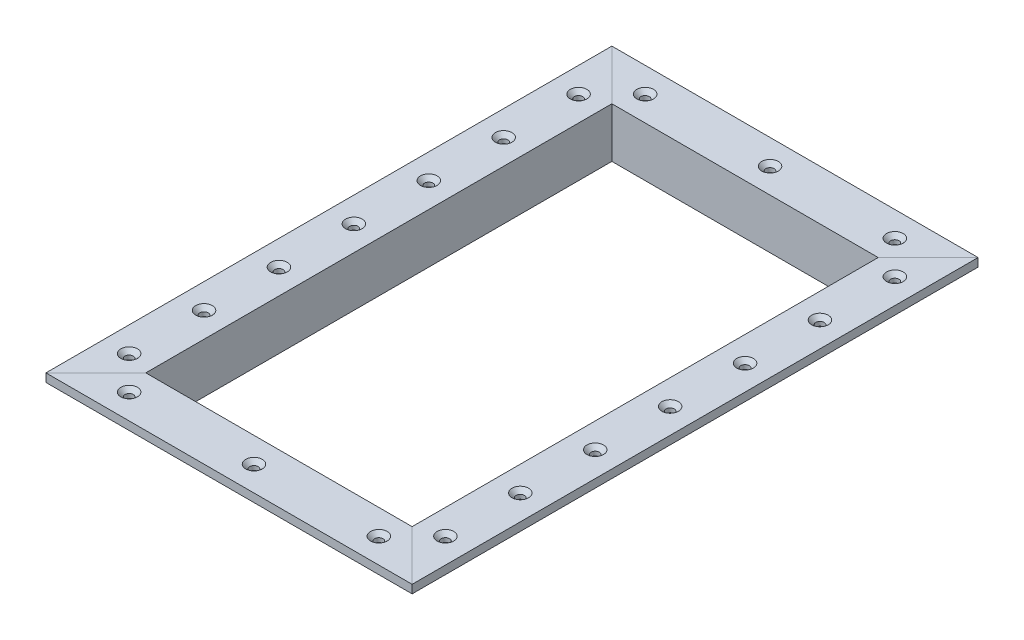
ISO-10303-21;
HEADER;
FILE_DESCRIPTION(('STEP AP214'),'2;1');
FILE_NAME('part.step','',(''),(''),'','','');
FILE_SCHEMA(('AUTOMOTIVE_DESIGN { 1 0 10303 214 1 1 1 1 }'));
ENDSEC;
DATA;
#1=APPLICATION_CONTEXT('core data for automotive mechanical design processes');
#2=APPLICATION_PROTOCOL_DEFINITION('international standard','automotive_design',2000,#1);
#3=PRODUCT_CONTEXT('',#1,'mechanical');
#4=PRODUCT('Part','Part','',(#3));
#5=PRODUCT_RELATED_PRODUCT_CATEGORY('part','',(#4));
#6=PRODUCT_DEFINITION_FORMATION('','',#4);
#7=PRODUCT_DEFINITION_CONTEXT('part definition',#1,'design');
#8=PRODUCT_DEFINITION('design','',#6,#7);
#9=PRODUCT_DEFINITION_SHAPE('','',#8);
#10=(LENGTH_UNIT() NAMED_UNIT(*) SI_UNIT(.MILLI.,.METRE.));
#11=(NAMED_UNIT(*) PLANE_ANGLE_UNIT() SI_UNIT($,.RADIAN.));
#12=(NAMED_UNIT(*) SI_UNIT($,.STERADIAN.) SOLID_ANGLE_UNIT());
#13=UNCERTAINTY_MEASURE_WITH_UNIT(LENGTH_MEASURE(1.E-05),#10,'distance_accuracy_value','');
#14=(GEOMETRIC_REPRESENTATION_CONTEXT(3) GLOBAL_UNCERTAINTY_ASSIGNED_CONTEXT((#13)) GLOBAL_UNIT_ASSIGNED_CONTEXT((#10,
#11,#12)) REPRESENTATION_CONTEXT('',''));
#15=CARTESIAN_POINT('',(0.,0.,0.));
#16=DIRECTION('',(0.,0.,1.));
#17=DIRECTION('',(1.,0.,0.));
#18=AXIS2_PLACEMENT_3D('',#15,#16,#17);
#19=CARTESIAN_POINT('',(0.,-3.175,88.9));
#20=DIRECTION('',(0.,1.,0.));
#21=DIRECTION('',(0.,0.,1.));
#22=AXIS2_PLACEMENT_3D('',#19,#20,#21);
#23=PLANE('',#22);
#24=CARTESIAN_POINT('',(9.52500000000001,-3.175,85.725));
#25=DIRECTION('',(0.,1.,0.));
#26=DIRECTION('',(0.,0.,1.));
#27=AXIS2_PLACEMENT_3D('',#24,#25,#26);
#28=CIRCLE('',#27,1.58750000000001);
#29=CARTESIAN_POINT('',(9.52500000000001,-3.175,87.3125));
#30=VERTEX_POINT('',#29);
#31=EDGE_CURVE('E183',#30,#30,#28,.T.);
#32=ORIENTED_EDGE('',*,*,#31,.T.);
#33=EDGE_LOOP('',(#32));
#34=FACE_BOUND('',#33,.T.);
#35=CARTESIAN_POINT('',(9.5250000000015,-3.175,57.15));
#36=DIRECTION('',(0.,1.,0.));
#37=DIRECTION('',(0.,0.,1.));
#38=AXIS2_PLACEMENT_3D('',#35,#36,#37);
#39=CIRCLE('',#38,1.58750000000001);
#40=CARTESIAN_POINT('',(9.5250000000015,-3.175,58.7375));
#41=VERTEX_POINT('',#40);
#42=EDGE_CURVE('E187',#41,#41,#39,.T.);
#43=ORIENTED_EDGE('',*,*,#42,.T.);
#44=EDGE_LOOP('',(#43));
#45=FACE_BOUND('',#44,.T.);
#46=CARTESIAN_POINT('',(9.5250000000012,-3.175,28.575));
#47=DIRECTION('',(0.,1.,0.));
#48=DIRECTION('',(0.,0.,1.));
#49=AXIS2_PLACEMENT_3D('',#46,#47,#48);
#50=CIRCLE('',#49,1.58750000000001);
#51=CARTESIAN_POINT('',(9.5250000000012,-3.175,30.1625));
#52=VERTEX_POINT('',#51);
#53=EDGE_CURVE('E191',#52,#52,#50,.T.);
#54=ORIENTED_EDGE('',*,*,#53,.T.);
#55=EDGE_LOOP('',(#54));
#56=FACE_BOUND('',#55,.T.);
#57=CARTESIAN_POINT('',(9.52500000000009,-3.175,0.));
#58=DIRECTION('',(0.,1.,0.));
#59=DIRECTION('',(0.,0.,1.));
#60=AXIS2_PLACEMENT_3D('',#57,#58,#59);
#61=CIRCLE('',#60,1.58750000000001);
#62=CARTESIAN_POINT('',(9.52500000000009,-3.175,1.58750000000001));
#63=VERTEX_POINT('',#62);
#64=EDGE_CURVE('E195',#63,#63,#61,.T.);
#65=ORIENTED_EDGE('',*,*,#64,.T.);
#66=EDGE_LOOP('',(#65));
#67=FACE_BOUND('',#66,.T.);
#68=CARTESIAN_POINT('',(9.5250000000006,-3.175,-28.575));
#69=DIRECTION('',(0.,1.,0.));
#70=DIRECTION('',(0.,0.,1.));
#71=AXIS2_PLACEMENT_3D('',#68,#69,#70);
#72=CIRCLE('',#71,1.58750000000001);
#73=CARTESIAN_POINT('',(9.5250000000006,-3.175,-26.9875));
#74=VERTEX_POINT('',#73);
#75=EDGE_CURVE('E199',#74,#74,#72,.T.);
#76=ORIENTED_EDGE('',*,*,#75,.T.);
#77=EDGE_LOOP('',(#76));
#78=FACE_BOUND('',#77,.T.);
#79=CARTESIAN_POINT('',(9.5250000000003,-3.175,-57.15));
#80=DIRECTION('',(0.,1.,0.));
#81=DIRECTION('',(0.,0.,1.));
#82=AXIS2_PLACEMENT_3D('',#79,#80,#81);
#83=CIRCLE('',#82,1.58750000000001);
#84=CARTESIAN_POINT('',(9.5250000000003,-3.175,-55.5625));
#85=VERTEX_POINT('',#84);
#86=EDGE_CURVE('E203',#85,#85,#83,.T.);
#87=ORIENTED_EDGE('',*,*,#86,.T.);
#88=EDGE_LOOP('',(#87));
#89=FACE_BOUND('',#88,.T.);
#90=CARTESIAN_POINT('',(9.525,-3.175,-85.725));
#91=DIRECTION('',(0.,1.,0.));
#92=DIRECTION('',(0.,0.,1.));
#93=AXIS2_PLACEMENT_3D('',#90,#91,#92);
#94=CIRCLE('',#93,1.58750000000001);
#95=CARTESIAN_POINT('',(9.525,-3.175,-84.1375));
#96=VERTEX_POINT('',#95);
#97=EDGE_CURVE('E206',#96,#96,#94,.T.);
#98=ORIENTED_EDGE('',*,*,#97,.T.);
#99=EDGE_LOOP('',(#98));
#100=FACE_BOUND('',#99,.T.);
#101=DIRECTION('',(0.,0.,-1.));
#102=VECTOR('',#101,1.);
#103=CARTESIAN_POINT('',(15.875,-3.175,88.9));
#104=LINE('',#103,#102);
#105=CARTESIAN_POINT('',(15.875,-3.175,92.0390789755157));
#106=VERTEX_POINT('',#105);
#107=CARTESIAN_POINT('',(15.875,-3.175,-92.0390789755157));
#108=VERTEX_POINT('',#107);
#109=EDGE_CURVE('E133',#106,#108,#104,.T.);
#110=ORIENTED_EDGE('',*,*,#109,.F.);
#111=DIRECTION('',(-0.707106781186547,0.,0.707106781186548));
#112=VECTOR('',#111,1.);
#113=CARTESIAN_POINT('',(9.50703948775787,-3.175,98.4070394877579));
#114=LINE('',#113,#112);
#115=CARTESIAN_POINT('',(0.,-3.175,107.914078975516));
#116=VERTEX_POINT('',#115);
#117=EDGE_CURVE('E129',#106,#116,#114,.T.);
#118=ORIENTED_EDGE('',*,*,#117,.T.);
#119=DIRECTION('',(0.,0.,-1.));
#120=VECTOR('',#119,1.);
#121=CARTESIAN_POINT('',(0.,-3.175,88.9));
#122=LINE('',#121,#120);
#123=CARTESIAN_POINT('',(0.,-3.175,-107.914078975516));
#124=VERTEX_POINT('',#123);
#125=EDGE_CURVE('E131',#116,#124,#122,.T.);
#126=ORIENTED_EDGE('',*,*,#125,.T.);
#127=DIRECTION('',(0.707106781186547,0.,0.707106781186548));
#128=VECTOR('',#127,1.);
#129=CARTESIAN_POINT('',(98.4070394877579,-3.175,-9.5070394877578));
#130=LINE('',#129,#128);
#131=EDGE_CURVE('E135',#124,#108,#130,.T.);
#132=ORIENTED_EDGE('',*,*,#131,.T.);
#133=EDGE_LOOP('',(#110,#118,#126,#132));
#134=FACE_BOUND('',#133,.T.);
#135=ADVANCED_FACE('F44',(#34,#45,#56,#67,#78,#89,#100,#134),#23,.F.);
#136=CARTESIAN_POINT('',(15.875,-19.05,88.9));
#137=DIRECTION('',(0.,1.,0.));
#138=DIRECTION('',(0.,0.,1.));
#139=AXIS2_PLACEMENT_3D('',#136,#137,#138);
#140=PLANE('',#139);
#141=DIRECTION('',(0.,0.,-1.));
#142=VECTOR('',#141,1.);
#143=CARTESIAN_POINT('',(19.05,-19.05,88.9));
#144=LINE('',#143,#142);
#145=CARTESIAN_POINT('',(19.05,-19.05,88.8640789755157));
#146=VERTEX_POINT('',#145);
#147=CARTESIAN_POINT('',(19.05,-19.05,-88.8640789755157));
#148=VERTEX_POINT('',#147);
#149=EDGE_CURVE('E95',#146,#148,#144,.T.);
#150=ORIENTED_EDGE('',*,*,#149,.F.);
#151=DIRECTION('',(-0.707106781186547,0.,0.707106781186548));
#152=VECTOR('',#151,1.);
#153=CARTESIAN_POINT('',(17.4445394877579,-19.05,90.4695394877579));
#154=LINE('',#153,#152);
#155=CARTESIAN_POINT('',(15.875,-19.05,92.0390789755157));
#156=VERTEX_POINT('',#155);
#157=EDGE_CURVE('E77',#146,#156,#154,.T.);
#158=ORIENTED_EDGE('',*,*,#157,.T.);
#159=DIRECTION('',(0.,0.,-1.));
#160=VECTOR('',#159,1.);
#161=CARTESIAN_POINT('',(15.875,-19.05,88.9));
#162=LINE('',#161,#160);
#163=CARTESIAN_POINT('',(15.875,-19.05,-92.0390789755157));
#164=VERTEX_POINT('',#163);
#165=EDGE_CURVE('E116',#156,#164,#162,.T.);
#166=ORIENTED_EDGE('',*,*,#165,.T.);
#167=DIRECTION('',(0.707106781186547,0.,0.707106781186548));
#168=VECTOR('',#167,1.);
#169=CARTESIAN_POINT('',(106.344539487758,-19.05,-1.56953948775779));
#170=LINE('',#169,#168);
#171=EDGE_CURVE('E109',#164,#148,#170,.T.);
#172=ORIENTED_EDGE('',*,*,#171,.T.);
#173=EDGE_LOOP('',(#150,#158,#166,#172));
#174=FACE_BOUND('',#173,.T.);
#175=ADVANCED_FACE('F114',(#174),#140,.F.);
#176=CARTESIAN_POINT('',(0.,0.,88.9));
#177=DIRECTION('',(0.,-1.,0.));
#178=DIRECTION('',(0.,0.,-1.));
#179=AXIS2_PLACEMENT_3D('',#176,#177,#178);
#180=PLANE('',#179);
#181=CARTESIAN_POINT('',(9.52500000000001,0.,85.725));
#182=DIRECTION('',(0.,-1.,0.));
#183=DIRECTION('',(0.,0.,-1.));
#184=AXIS2_PLACEMENT_3D('',#181,#182,#183);
#185=CIRCLE('',#184,3.175);
#186=CARTESIAN_POINT('',(9.52500000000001,0.,82.55));
#187=VERTEX_POINT('',#186);
#188=EDGE_CURVE('E250',#187,#187,#185,.T.);
#189=ORIENTED_EDGE('',*,*,#188,.T.);
#190=EDGE_LOOP('',(#189));
#191=FACE_BOUND('',#190,.T.);
#192=CARTESIAN_POINT('',(9.5250000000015,0.,57.15));
#193=DIRECTION('',(0.,-1.,0.));
#194=DIRECTION('',(0.,0.,-1.));
#195=AXIS2_PLACEMENT_3D('',#192,#193,#194);
#196=CIRCLE('',#195,3.175);
#197=CARTESIAN_POINT('',(9.5250000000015,0.,53.975));
#198=VERTEX_POINT('',#197);
#199=EDGE_CURVE('E244',#198,#198,#196,.T.);
#200=ORIENTED_EDGE('',*,*,#199,.T.);
#201=EDGE_LOOP('',(#200));
#202=FACE_BOUND('',#201,.T.);
#203=CARTESIAN_POINT('',(9.5250000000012,0.,28.575));
#204=DIRECTION('',(0.,-1.,0.));
#205=DIRECTION('',(0.,0.,-1.));
#206=AXIS2_PLACEMENT_3D('',#203,#204,#205);
#207=CIRCLE('',#206,3.175);
#208=CARTESIAN_POINT('',(9.5250000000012,0.,25.4));
#209=VERTEX_POINT('',#208);
#210=EDGE_CURVE('E237',#209,#209,#207,.T.);
#211=ORIENTED_EDGE('',*,*,#210,.T.);
#212=EDGE_LOOP('',(#211));
#213=FACE_BOUND('',#212,.T.);
#214=CARTESIAN_POINT('',(9.52500000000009,0.,0.));
#215=DIRECTION('',(0.,-1.,0.));
#216=DIRECTION('',(0.,0.,-1.));
#217=AXIS2_PLACEMENT_3D('',#214,#215,#216);
#218=CIRCLE('',#217,3.175);
#219=CARTESIAN_POINT('',(9.52500000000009,0.,-3.175));
#220=VERTEX_POINT('',#219);
#221=EDGE_CURVE('E230',#220,#220,#218,.T.);
#222=ORIENTED_EDGE('',*,*,#221,.T.);
#223=EDGE_LOOP('',(#222));
#224=FACE_BOUND('',#223,.T.);
#225=CARTESIAN_POINT('',(9.5250000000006,0.,-28.575));
#226=DIRECTION('',(0.,-1.,0.));
#227=DIRECTION('',(0.,0.,-1.));
#228=AXIS2_PLACEMENT_3D('',#225,#226,#227);
#229=CIRCLE('',#228,3.175);
#230=CARTESIAN_POINT('',(9.5250000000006,0.,-31.75));
#231=VERTEX_POINT('',#230);
#232=EDGE_CURVE('E223',#231,#231,#229,.T.);
#233=ORIENTED_EDGE('',*,*,#232,.T.);
#234=EDGE_LOOP('',(#233));
#235=FACE_BOUND('',#234,.T.);
#236=CARTESIAN_POINT('',(9.5250000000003,0.,-57.15));
#237=DIRECTION('',(0.,-1.,0.));
#238=DIRECTION('',(0.,0.,-1.));
#239=AXIS2_PLACEMENT_3D('',#236,#237,#238);
#240=CIRCLE('',#239,3.175);
#241=CARTESIAN_POINT('',(9.5250000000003,0.,-60.325));
#242=VERTEX_POINT('',#241);
#243=EDGE_CURVE('E216',#242,#242,#240,.T.);
#244=ORIENTED_EDGE('',*,*,#243,.T.);
#245=EDGE_LOOP('',(#244));
#246=FACE_BOUND('',#245,.T.);
#247=CARTESIAN_POINT('',(9.525,0.,-85.725));
#248=DIRECTION('',(0.,-1.,0.));
#249=DIRECTION('',(0.,0.,-1.));
#250=AXIS2_PLACEMENT_3D('',#247,#248,#249);
#251=CIRCLE('',#250,3.175);
#252=CARTESIAN_POINT('',(9.525,0.,-88.9));
#253=VERTEX_POINT('',#252);
#254=EDGE_CURVE('E208',#253,#253,#251,.T.);
#255=ORIENTED_EDGE('',*,*,#254,.T.);
#256=EDGE_LOOP('',(#255));
#257=FACE_BOUND('',#256,.T.);
#258=DIRECTION('',(0.,0.,-1.));
#259=VECTOR('',#258,1.);
#260=CARTESIAN_POINT('',(0.,0.,88.9));
#261=LINE('',#260,#259);
#262=CARTESIAN_POINT('',(0.,0.,107.914078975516));
#263=VERTEX_POINT('',#262);
#264=CARTESIAN_POINT('',(0.,0.,-107.914078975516));
#265=VERTEX_POINT('',#264);
#266=EDGE_CURVE('E128',#263,#265,#261,.T.);
#267=ORIENTED_EDGE('',*,*,#266,.F.);
#268=DIRECTION('',(-0.707106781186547,0.,0.707106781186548));
#269=VECTOR('',#268,1.);
#270=CARTESIAN_POINT('',(19.0320394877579,0.,88.8820394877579));
#271=LINE('',#270,#269);
#272=CARTESIAN_POINT('',(19.05,0.,88.8640789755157));
#273=VERTEX_POINT('',#272);
#274=EDGE_CURVE('E12',#273,#263,#271,.T.);
#275=ORIENTED_EDGE('',*,*,#274,.F.);
#276=DIRECTION('',(0.,0.,-1.));
#277=VECTOR('',#276,1.);
#278=CARTESIAN_POINT('',(19.05,0.,88.9));
#279=LINE('',#278,#277);
#280=CARTESIAN_POINT('',(19.05,0.,-88.8640789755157));
#281=VERTEX_POINT('',#280);
#282=EDGE_CURVE('E117',#273,#281,#279,.T.);
#283=ORIENTED_EDGE('',*,*,#282,.T.);
#284=DIRECTION('',(0.707106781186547,0.,0.707106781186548));
#285=VECTOR('',#284,1.);
#286=CARTESIAN_POINT('',(19.0320394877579,0.,-88.8820394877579));
#287=LINE('',#286,#285);
#288=EDGE_CURVE('E52',#265,#281,#287,.T.);
#289=ORIENTED_EDGE('',*,*,#288,.F.);
#290=EDGE_LOOP('',(#267,#275,#283,#289));
#291=FACE_BOUND('',#290,.T.);
#292=ADVANCED_FACE('F161',(#191,#202,#213,#224,#235,#246,#257,#291),#180,.F.);
#293=CARTESIAN_POINT('',(0.,0.,88.9));
#294=DIRECTION('',(1.,0.,0.));
#295=DIRECTION('',(0.,0.,-1.));
#296=AXIS2_PLACEMENT_3D('',#293,#294,#295);
#297=PLANE('',#296);
#298=ORIENTED_EDGE('',*,*,#125,.F.);
#299=DIRECTION('',(0.,1.,0.));
#300=VECTOR('',#299,1.);
#301=CARTESIAN_POINT('',(0.,0.,107.914078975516));
#302=LINE('',#301,#300);
#303=EDGE_CURVE('E59',#116,#263,#302,.T.);
#304=ORIENTED_EDGE('',*,*,#303,.T.);
#305=ORIENTED_EDGE('',*,*,#266,.T.);
#306=DIRECTION('',(0.,-1.,0.));
#307=VECTOR('',#306,1.);
#308=CARTESIAN_POINT('',(0.,0.,-107.914078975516));
#309=LINE('',#308,#307);
#310=EDGE_CURVE('E134',#265,#124,#309,.T.);
#311=ORIENTED_EDGE('',*,*,#310,.T.);
#312=EDGE_LOOP('',(#298,#304,#305,#311));
#313=FACE_BOUND('',#312,.T.);
#314=ADVANCED_FACE('F157',(#313),#297,.F.);
#315=CARTESIAN_POINT('',(15.875,-3.175,88.9));
#316=DIRECTION('',(1.,0.,0.));
#317=DIRECTION('',(0.,0.,-1.));
#318=AXIS2_PLACEMENT_3D('',#315,#316,#317);
#319=PLANE('',#318);
#320=ORIENTED_EDGE('',*,*,#165,.F.);
#321=DIRECTION('',(0.,1.,0.));
#322=VECTOR('',#321,1.);
#323=CARTESIAN_POINT('',(15.875,-3.175,92.0390789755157));
#324=LINE('',#323,#322);
#325=EDGE_CURVE('E73',#156,#106,#324,.T.);
#326=ORIENTED_EDGE('',*,*,#325,.T.);
#327=ORIENTED_EDGE('',*,*,#109,.T.);
#328=DIRECTION('',(0.,-1.,0.));
#329=VECTOR('',#328,1.);
#330=CARTESIAN_POINT('',(15.875,-3.175,-92.0390789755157));
#331=LINE('',#330,#329);
#332=EDGE_CURVE('E123',#108,#164,#331,.T.);
#333=ORIENTED_EDGE('',*,*,#332,.T.);
#334=EDGE_LOOP('',(#320,#326,#327,#333));
#335=FACE_BOUND('',#334,.T.);
#336=ADVANCED_FACE('F154',(#335),#319,.F.);
#337=CARTESIAN_POINT('',(19.05,0.,88.9));
#338=DIRECTION('',(-1.,0.,0.));
#339=DIRECTION('',(0.,0.,1.));
#340=AXIS2_PLACEMENT_3D('',#337,#338,#339);
#341=PLANE('',#340);
#342=ORIENTED_EDGE('',*,*,#282,.F.);
#343=DIRECTION('',(0.,-1.,0.));
#344=VECTOR('',#343,1.);
#345=CARTESIAN_POINT('',(19.05,0.,88.8640789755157));
#346=LINE('',#345,#344);
#347=EDGE_CURVE('E100',#273,#146,#346,.T.);
#348=ORIENTED_EDGE('',*,*,#347,.T.);
#349=ORIENTED_EDGE('',*,*,#149,.T.);
#350=DIRECTION('',(0.,1.,0.));
#351=VECTOR('',#350,1.);
#352=CARTESIAN_POINT('',(19.05,0.,-88.8640789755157));
#353=LINE('',#352,#351);
#354=EDGE_CURVE('E99',#148,#281,#353,.T.);
#355=ORIENTED_EDGE('',*,*,#354,.T.);
#356=EDGE_LOOP('',(#342,#348,#349,#355));
#357=FACE_BOUND('',#356,.T.);
#358=ADVANCED_FACE('F98',(#357),#341,.F.);
#359=CARTESIAN_POINT('',(19.0320394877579,-19.050025,-88.8820394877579));
#360=DIRECTION('',(-0.707106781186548,0.,0.707106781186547));
#361=DIRECTION('',(0.707106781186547,0.,0.707106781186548));
#362=AXIS2_PLACEMENT_3D('',#359,#360,#361);
#363=PLANE('',#362);
#364=ORIENTED_EDGE('',*,*,#288,.T.);
#365=ORIENTED_EDGE('',*,*,#354,.F.);
#366=ORIENTED_EDGE('',*,*,#171,.F.);
#367=ORIENTED_EDGE('',*,*,#332,.F.);
#368=ORIENTED_EDGE('',*,*,#131,.F.);
#369=ORIENTED_EDGE('',*,*,#310,.F.);
#370=EDGE_LOOP('',(#364,#365,#366,#367,#368,#369));
#371=FACE_BOUND('',#370,.T.);
#372=ADVANCED_FACE('F107',(#371),#363,.F.);
#373=CARTESIAN_POINT('',(19.0320394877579,-19.050025,88.8820394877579));
#374=DIRECTION('',(-0.707106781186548,0.,-0.707106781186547));
#375=DIRECTION('',(-0.707106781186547,0.,0.707106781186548));
#376=AXIS2_PLACEMENT_3D('',#373,#374,#375);
#377=PLANE('',#376);
#378=ORIENTED_EDGE('',*,*,#117,.F.);
#379=ORIENTED_EDGE('',*,*,#325,.F.);
#380=ORIENTED_EDGE('',*,*,#157,.F.);
#381=ORIENTED_EDGE('',*,*,#347,.F.);
#382=ORIENTED_EDGE('',*,*,#274,.T.);
#383=ORIENTED_EDGE('',*,*,#303,.F.);
#384=EDGE_LOOP('',(#378,#379,#380,#381,#382,#383));
#385=FACE_BOUND('',#384,.T.);
#386=ADVANCED_FACE('F162',(#385),#377,.F.);
#387=CARTESIAN_POINT('',(9.525,-4.27934782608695,-85.725));
#388=DIRECTION('',(0.,-1.,0.));
#389=DIRECTION('',(0.,0.,-1.));
#390=AXIS2_PLACEMENT_3D('',#387,#388,#389);
#391=CYLINDRICAL_SURFACE('',#390,1.58750000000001);
#392=CARTESIAN_POINT('',(9.525,-1.5875,-85.725));
#393=DIRECTION('',(0.,-1.,0.));
#394=DIRECTION('',(0.,0.,-1.));
#395=AXIS2_PLACEMENT_3D('',#392,#393,#394);
#396=CIRCLE('',#395,1.58750000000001);
#397=CARTESIAN_POINT('',(9.525,-1.5875,-87.3125));
#398=VERTEX_POINT('',#397);
#399=EDGE_CURVE('E132',#398,#398,#396,.T.);
#400=ORIENTED_EDGE('',*,*,#399,.F.);
#401=EDGE_LOOP('',(#400));
#402=FACE_BOUND('',#401,.T.);
#403=ORIENTED_EDGE('',*,*,#97,.F.);
#404=EDGE_LOOP('',(#403));
#405=FACE_BOUND('',#404,.T.);
#406=ADVANCED_FACE('F164',(#402,#405),#391,.F.);
#407=CARTESIAN_POINT('',(9.525,-1.5875,-85.725));
#408=DIRECTION('',(0.,1.,0.));
#409=DIRECTION('',(0.,0.,1.));
#410=AXIS2_PLACEMENT_3D('',#407,#408,#409);
#411=CONICAL_SURFACE('',#410,1.58750000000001,0.785398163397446);
#412=ORIENTED_EDGE('',*,*,#254,.F.);
#413=EDGE_LOOP('',(#412));
#414=FACE_BOUND('',#413,.T.);
#415=ORIENTED_EDGE('',*,*,#399,.T.);
#416=EDGE_LOOP('',(#415));
#417=FACE_BOUND('',#416,.T.);
#418=ADVANCED_FACE('F170',(#414,#417),#411,.F.);
#419=CARTESIAN_POINT('',(9.5250000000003,-4.27934782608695,-57.15));
#420=DIRECTION('',(0.,-1.,0.));
#421=DIRECTION('',(0.,0.,-1.));
#422=AXIS2_PLACEMENT_3D('',#419,#420,#421);
#423=CYLINDRICAL_SURFACE('',#422,1.58750000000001);
#424=CARTESIAN_POINT('',(9.5250000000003,-1.5875,-57.15));
#425=DIRECTION('',(0.,-1.,0.));
#426=DIRECTION('',(0.,0.,-1.));
#427=AXIS2_PLACEMENT_3D('',#424,#425,#426);
#428=CIRCLE('',#427,1.58750000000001);
#429=CARTESIAN_POINT('',(9.5250000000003,-1.5875,-58.7375));
#430=VERTEX_POINT('',#429);
#431=EDGE_CURVE('E213',#430,#430,#428,.T.);
#432=ORIENTED_EDGE('',*,*,#431,.F.);
#433=EDGE_LOOP('',(#432));
#434=FACE_BOUND('',#433,.T.);
#435=ORIENTED_EDGE('',*,*,#86,.F.);
#436=EDGE_LOOP('',(#435));
#437=FACE_BOUND('',#436,.T.);
#438=ADVANCED_FACE('F322',(#434,#437),#423,.F.);
#439=CARTESIAN_POINT('',(9.5250000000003,-1.5875,-57.15));
#440=DIRECTION('',(0.,1.,0.));
#441=DIRECTION('',(0.,0.,1.));
#442=AXIS2_PLACEMENT_3D('',#439,#440,#441);
#443=CONICAL_SURFACE('',#442,1.58750000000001,0.785398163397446);
#444=ORIENTED_EDGE('',*,*,#243,.F.);
#445=EDGE_LOOP('',(#444));
#446=FACE_BOUND('',#445,.T.);
#447=ORIENTED_EDGE('',*,*,#431,.T.);
#448=EDGE_LOOP('',(#447));
#449=FACE_BOUND('',#448,.T.);
#450=ADVANCED_FACE('F332',(#446,#449),#443,.F.);
#451=CARTESIAN_POINT('',(9.5250000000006,-4.27934782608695,-28.575));
#452=DIRECTION('',(0.,-1.,0.));
#453=DIRECTION('',(0.,0.,-1.));
#454=AXIS2_PLACEMENT_3D('',#451,#452,#453);
#455=CYLINDRICAL_SURFACE('',#454,1.58750000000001);
#456=CARTESIAN_POINT('',(9.5250000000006,-1.5875,-28.575));
#457=DIRECTION('',(0.,-1.,0.));
#458=DIRECTION('',(0.,0.,-1.));
#459=AXIS2_PLACEMENT_3D('',#456,#457,#458);
#460=CIRCLE('',#459,1.58750000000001);
#461=CARTESIAN_POINT('',(9.5250000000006,-1.5875,-30.1625));
#462=VERTEX_POINT('',#461);
#463=EDGE_CURVE('E219',#462,#462,#460,.T.);
#464=ORIENTED_EDGE('',*,*,#463,.F.);
#465=EDGE_LOOP('',(#464));
#466=FACE_BOUND('',#465,.T.);
#467=ORIENTED_EDGE('',*,*,#75,.F.);
#468=EDGE_LOOP('',(#467));
#469=FACE_BOUND('',#468,.T.);
#470=ADVANCED_FACE('F342',(#466,#469),#455,.F.);
#471=CARTESIAN_POINT('',(9.5250000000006,-1.5875,-28.575));
#472=DIRECTION('',(0.,1.,0.));
#473=DIRECTION('',(0.,0.,1.));
#474=AXIS2_PLACEMENT_3D('',#471,#472,#473);
#475=CONICAL_SURFACE('',#474,1.58750000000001,0.785398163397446);
#476=ORIENTED_EDGE('',*,*,#232,.F.);
#477=EDGE_LOOP('',(#476));
#478=FACE_BOUND('',#477,.T.);
#479=ORIENTED_EDGE('',*,*,#463,.T.);
#480=EDGE_LOOP('',(#479));
#481=FACE_BOUND('',#480,.T.);
#482=ADVANCED_FACE('F352',(#478,#481),#475,.F.);
#483=CARTESIAN_POINT('',(9.52500000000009,-4.27934782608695,0.));
#484=DIRECTION('',(0.,-1.,0.));
#485=DIRECTION('',(0.,0.,-1.));
#486=AXIS2_PLACEMENT_3D('',#483,#484,#485);
#487=CYLINDRICAL_SURFACE('',#486,1.58750000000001);
#488=CARTESIAN_POINT('',(9.52500000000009,-1.5875,0.));
#489=DIRECTION('',(0.,-1.,0.));
#490=DIRECTION('',(0.,0.,-1.));
#491=AXIS2_PLACEMENT_3D('',#488,#489,#490);
#492=CIRCLE('',#491,1.58750000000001);
#493=CARTESIAN_POINT('',(9.52500000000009,-1.5875,-1.58750000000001));
#494=VERTEX_POINT('',#493);
#495=EDGE_CURVE('E226',#494,#494,#492,.T.);
#496=ORIENTED_EDGE('',*,*,#495,.F.);
#497=EDGE_LOOP('',(#496));
#498=FACE_BOUND('',#497,.T.);
#499=ORIENTED_EDGE('',*,*,#64,.F.);
#500=EDGE_LOOP('',(#499));
#501=FACE_BOUND('',#500,.T.);
#502=ADVANCED_FACE('F362',(#498,#501),#487,.F.);
#503=CARTESIAN_POINT('',(9.52500000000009,-1.5875,0.));
#504=DIRECTION('',(0.,1.,0.));
#505=DIRECTION('',(0.,0.,1.));
#506=AXIS2_PLACEMENT_3D('',#503,#504,#505);
#507=CONICAL_SURFACE('',#506,1.58750000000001,0.785398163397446);
#508=ORIENTED_EDGE('',*,*,#221,.F.);
#509=EDGE_LOOP('',(#508));
#510=FACE_BOUND('',#509,.T.);
#511=ORIENTED_EDGE('',*,*,#495,.T.);
#512=EDGE_LOOP('',(#511));
#513=FACE_BOUND('',#512,.T.);
#514=ADVANCED_FACE('F372',(#510,#513),#507,.F.);
#515=CARTESIAN_POINT('',(9.5250000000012,-4.27934782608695,28.575));
#516=DIRECTION('',(0.,-1.,0.));
#517=DIRECTION('',(0.,0.,-1.));
#518=AXIS2_PLACEMENT_3D('',#515,#516,#517);
#519=CYLINDRICAL_SURFACE('',#518,1.58750000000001);
#520=CARTESIAN_POINT('',(9.5250000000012,-1.5875,28.575));
#521=DIRECTION('',(0.,-1.,0.));
#522=DIRECTION('',(0.,0.,-1.));
#523=AXIS2_PLACEMENT_3D('',#520,#521,#522);
#524=CIRCLE('',#523,1.58750000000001);
#525=CARTESIAN_POINT('',(9.5250000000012,-1.5875,26.9875));
#526=VERTEX_POINT('',#525);
#527=EDGE_CURVE('E233',#526,#526,#524,.T.);
#528=ORIENTED_EDGE('',*,*,#527,.F.);
#529=EDGE_LOOP('',(#528));
#530=FACE_BOUND('',#529,.T.);
#531=ORIENTED_EDGE('',*,*,#53,.F.);
#532=EDGE_LOOP('',(#531));
#533=FACE_BOUND('',#532,.T.);
#534=ADVANCED_FACE('F382',(#530,#533),#519,.F.);
#535=CARTESIAN_POINT('',(9.5250000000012,-1.5875,28.575));
#536=DIRECTION('',(0.,1.,0.));
#537=DIRECTION('',(0.,0.,1.));
#538=AXIS2_PLACEMENT_3D('',#535,#536,#537);
#539=CONICAL_SURFACE('',#538,1.58750000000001,0.785398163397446);
#540=ORIENTED_EDGE('',*,*,#210,.F.);
#541=EDGE_LOOP('',(#540));
#542=FACE_BOUND('',#541,.T.);
#543=ORIENTED_EDGE('',*,*,#527,.T.);
#544=EDGE_LOOP('',(#543));
#545=FACE_BOUND('',#544,.T.);
#546=ADVANCED_FACE('F392',(#542,#545),#539,.F.);
#547=CARTESIAN_POINT('',(9.5250000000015,-4.27934782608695,57.15));
#548=DIRECTION('',(0.,-1.,0.));
#549=DIRECTION('',(0.,0.,-1.));
#550=AXIS2_PLACEMENT_3D('',#547,#548,#549);
#551=CYLINDRICAL_SURFACE('',#550,1.58750000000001);
#552=CARTESIAN_POINT('',(9.5250000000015,-1.5875,57.15));
#553=DIRECTION('',(0.,-1.,0.));
#554=DIRECTION('',(0.,0.,-1.));
#555=AXIS2_PLACEMENT_3D('',#552,#553,#554);
#556=CIRCLE('',#555,1.58750000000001);
#557=CARTESIAN_POINT('',(9.5250000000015,-1.5875,55.5625));
#558=VERTEX_POINT('',#557);
#559=EDGE_CURVE('E240',#558,#558,#556,.T.);
#560=ORIENTED_EDGE('',*,*,#559,.F.);
#561=EDGE_LOOP('',(#560));
#562=FACE_BOUND('',#561,.T.);
#563=ORIENTED_EDGE('',*,*,#42,.F.);
#564=EDGE_LOOP('',(#563));
#565=FACE_BOUND('',#564,.T.);
#566=ADVANCED_FACE('F268',(#562,#565),#551,.F.);
#567=CARTESIAN_POINT('',(9.5250000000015,-1.5875,57.15));
#568=DIRECTION('',(0.,1.,0.));
#569=DIRECTION('',(0.,0.,1.));
#570=AXIS2_PLACEMENT_3D('',#567,#568,#569);
#571=CONICAL_SURFACE('',#570,1.58750000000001,0.785398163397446);
#572=ORIENTED_EDGE('',*,*,#199,.F.);
#573=EDGE_LOOP('',(#572));
#574=FACE_BOUND('',#573,.T.);
#575=ORIENTED_EDGE('',*,*,#559,.T.);
#576=EDGE_LOOP('',(#575));
#577=FACE_BOUND('',#576,.T.);
#578=ADVANCED_FACE('F260',(#574,#577),#571,.F.);
#579=CARTESIAN_POINT('',(9.52500000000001,-4.27934782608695,85.725));
#580=DIRECTION('',(0.,-1.,0.));
#581=DIRECTION('',(0.,0.,-1.));
#582=AXIS2_PLACEMENT_3D('',#579,#580,#581);
#583=CYLINDRICAL_SURFACE('',#582,1.58750000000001);
#584=CARTESIAN_POINT('',(9.52500000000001,-1.5875,85.725));
#585=DIRECTION('',(0.,-1.,0.));
#586=DIRECTION('',(0.,0.,-1.));
#587=AXIS2_PLACEMENT_3D('',#584,#585,#586);
#588=CIRCLE('',#587,1.58750000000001);
#589=CARTESIAN_POINT('',(9.52500000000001,-1.5875,84.1375));
#590=VERTEX_POINT('',#589);
#591=EDGE_CURVE('E151',#590,#590,#588,.T.);
#592=ORIENTED_EDGE('',*,*,#591,.F.);
#593=EDGE_LOOP('',(#592));
#594=FACE_BOUND('',#593,.T.);
#595=ORIENTED_EDGE('',*,*,#31,.F.);
#596=EDGE_LOOP('',(#595));
#597=FACE_BOUND('',#596,.T.);
#598=ADVANCED_FACE('F257',(#594,#597),#583,.F.);
#599=CARTESIAN_POINT('',(9.52500000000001,-1.5875,85.725));
#600=DIRECTION('',(0.,1.,0.));
#601=DIRECTION('',(0.,0.,1.));
#602=AXIS2_PLACEMENT_3D('',#599,#600,#601);
#603=CONICAL_SURFACE('',#602,1.58750000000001,0.785398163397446);
#604=ORIENTED_EDGE('',*,*,#188,.F.);
#605=EDGE_LOOP('',(#604));
#606=FACE_BOUND('',#605,.T.);
#607=ORIENTED_EDGE('',*,*,#591,.T.);
#608=EDGE_LOOP('',(#607));
#609=FACE_BOUND('',#608,.T.);
#610=ADVANCED_FACE('F255',(#606,#609),#603,.F.);
#611=CLOSED_SHELL('',(#135,#175,#292,#314,#336,#358,#372,#386,#406,#418,#438,#450,#470,#482,
#502,#514,#534,#546,#566,#578,#598,#610));
#612=MANIFOLD_SOLID_BREP('B2',#611);
#613=CARTESIAN_POINT('',(139.682039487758,-19.050025,107.967960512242));
#614=DIRECTION('',(-0.707106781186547,0.,0.707106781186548));
#615=DIRECTION('',(0.707106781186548,0.,0.707106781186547));
#616=AXIS2_PLACEMENT_3D('',#613,#614,#615);
#617=PLANE('',#616);
#618=DIRECTION('',(0.,1.,0.));
#619=VECTOR('',#618,1.);
#620=CARTESIAN_POINT('',(120.614078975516,-144.167881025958,88.9));
#621=LINE('',#620,#619);
#622=CARTESIAN_POINT('',(120.614078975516,-19.05,88.9));
#623=VERTEX_POINT('',#622);
#624=CARTESIAN_POINT('',(120.614078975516,0.,88.9));
#625=VERTEX_POINT('',#624);
#626=EDGE_CURVE('E568',#623,#625,#621,.T.);
#627=ORIENTED_EDGE('',*,*,#626,.T.);
#628=DIRECTION('',(0.707106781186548,0.,0.707106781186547));
#629=VECTOR('',#628,1.);
#630=CARTESIAN_POINT('',(139.682039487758,0.,107.967960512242));
#631=LINE('',#630,#629);
#632=CARTESIAN_POINT('',(139.664078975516,0.,107.95));
#633=VERTEX_POINT('',#632);
#634=EDGE_CURVE('E586',#625,#633,#631,.T.);
#635=ORIENTED_EDGE('',*,*,#634,.T.);
#636=DIRECTION('',(0.,-1.,0.));
#637=VECTOR('',#636,1.);
#638=CARTESIAN_POINT('',(139.664078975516,-144.167881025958,107.95));
#639=LINE('',#638,#637);
#640=CARTESIAN_POINT('',(139.664078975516,-3.175,107.95));
#641=VERTEX_POINT('',#640);
#642=EDGE_CURVE('E539',#633,#641,#639,.T.);
#643=ORIENTED_EDGE('',*,*,#642,.T.);
#644=DIRECTION('',(0.707106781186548,0.,0.707106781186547));
#645=VECTOR('',#644,1.);
#646=CARTESIAN_POINT('',(60.3070394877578,-3.175,28.5929605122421));
#647=LINE('',#646,#645);
#648=CARTESIAN_POINT('',(123.789078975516,-3.175,92.075));
#649=VERTEX_POINT('',#648);
#650=EDGE_CURVE('E583',#649,#641,#647,.T.);
#651=ORIENTED_EDGE('',*,*,#650,.F.);
#652=DIRECTION('',(0.,1.,0.));
#653=VECTOR('',#652,1.);
#654=CARTESIAN_POINT('',(123.789078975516,-127.046681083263,92.075));
#655=LINE('',#654,#653);
#656=CARTESIAN_POINT('',(123.789078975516,-19.05,92.075));
#657=VERTEX_POINT('',#656);
#658=EDGE_CURVE('E608',#657,#649,#655,.T.);
#659=ORIENTED_EDGE('',*,*,#658,.F.);
#660=DIRECTION('',(0.707106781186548,0.,0.707106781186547));
#661=VECTOR('',#660,1.);
#662=CARTESIAN_POINT('',(68.2445394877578,-19.05,36.5304605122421));
#663=LINE('',#662,#661);
#664=EDGE_CURVE('E554',#623,#657,#663,.T.);
#665=ORIENTED_EDGE('',*,*,#664,.F.);
#666=EDGE_LOOP('',(#627,#635,#643,#651,#659,#665));
#667=FACE_BOUND('',#666,.T.);
#668=ADVANCED_FACE('F531',(#667),#617,.F.);
#669=CARTESIAN_POINT('',(0.,-144.167881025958,107.95));
#670=DIRECTION('',(0.,0.,1.));
#671=DIRECTION('',(1.,0.,0.));
#672=AXIS2_PLACEMENT_3D('',#669,#670,#671);
#673=PLANE('',#672);
#674=DIRECTION('',(0.,1.,0.));
#675=VECTOR('',#674,1.);
#676=CARTESIAN_POINT('',(0.0359210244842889,-144.167881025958,107.95));
#677=LINE('',#676,#675);
#678=CARTESIAN_POINT('',(0.0359210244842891,-3.175,107.95));
#679=VERTEX_POINT('',#678);
#680=CARTESIAN_POINT('',(0.0359210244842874,0.,107.95));
#681=VERTEX_POINT('',#680);
#682=EDGE_CURVE('E600',#679,#681,#677,.T.);
#683=ORIENTED_EDGE('',*,*,#682,.F.);
#684=DIRECTION('',(-1.,0.,0.));
#685=VECTOR('',#684,1.);
#686=CARTESIAN_POINT('',(0.,-3.17500000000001,107.95));
#687=LINE('',#686,#685);
#688=EDGE_CURVE('E594',#641,#679,#687,.T.);
#689=ORIENTED_EDGE('',*,*,#688,.F.);
#690=ORIENTED_EDGE('',*,*,#642,.F.);
#691=DIRECTION('',(1.,0.,0.));
#692=VECTOR('',#691,1.);
#693=CARTESIAN_POINT('',(0.,0.,107.95));
#694=LINE('',#693,#692);
#695=EDGE_CURVE('E602',#681,#633,#694,.T.);
#696=ORIENTED_EDGE('',*,*,#695,.F.);
#697=EDGE_LOOP('',(#683,#689,#690,#696));
#698=FACE_BOUND('',#697,.T.);
#699=ADVANCED_FACE('F599',(#698),#673,.T.);
#700=CARTESIAN_POINT('',(0.,-144.167881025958,88.9));
#701=DIRECTION('',(0.,0.,-1.));
#702=DIRECTION('',(-1.,0.,0.));
#703=AXIS2_PLACEMENT_3D('',#700,#701,#702);
#704=PLANE('',#703);
#705=DIRECTION('',(0.,-1.,0.));
#706=VECTOR('',#705,1.);
#707=CARTESIAN_POINT('',(19.0859210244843,-144.167881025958,88.9));
#708=LINE('',#707,#706);
#709=CARTESIAN_POINT('',(19.0859210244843,0.,88.9));
#710=VERTEX_POINT('',#709);
#711=CARTESIAN_POINT('',(19.0859210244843,-19.05,88.9));
#712=VERTEX_POINT('',#711);
#713=EDGE_CURVE('E597',#710,#712,#708,.T.);
#714=ORIENTED_EDGE('',*,*,#713,.F.);
#715=DIRECTION('',(-1.,0.,0.));
#716=VECTOR('',#715,1.);
#717=CARTESIAN_POINT('',(0.,0.,88.9));
#718=LINE('',#717,#716);
#719=EDGE_CURVE('E606',#625,#710,#718,.T.);
#720=ORIENTED_EDGE('',*,*,#719,.F.);
#721=ORIENTED_EDGE('',*,*,#626,.F.);
#722=DIRECTION('',(-1.,0.,0.));
#723=VECTOR('',#722,1.);
#724=CARTESIAN_POINT('',(15.875,-19.05,88.9));
#725=LINE('',#724,#723);
#726=EDGE_CURVE('E615',#623,#712,#725,.T.);
#727=ORIENTED_EDGE('',*,*,#726,.T.);
#728=EDGE_LOOP('',(#714,#720,#721,#727));
#729=FACE_BOUND('',#728,.T.);
#730=ADVANCED_FACE('F625',(#729),#704,.T.);
#731=CARTESIAN_POINT('',(0.,0.,88.9));
#732=DIRECTION('',(0.,-1.,0.));
#733=DIRECTION('',(0.,0.,-1.));
#734=AXIS2_PLACEMENT_3D('',#731,#732,#733);
#735=PLANE('',#734);
#736=CARTESIAN_POINT('',(117.475,0.,98.425));
#737=DIRECTION('',(0.,-1.,0.));
#738=DIRECTION('',(0.,0.,-1.));
#739=AXIS2_PLACEMENT_3D('',#736,#737,#738);
#740=CIRCLE('',#739,3.175);
#741=CARTESIAN_POINT('',(117.475,0.,95.25));
#742=VERTEX_POINT('',#741);
#743=EDGE_CURVE('E753',#742,#742,#740,.T.);
#744=ORIENTED_EDGE('',*,*,#743,.T.);
#745=EDGE_LOOP('',(#744));
#746=FACE_BOUND('',#745,.T.);
#747=CARTESIAN_POINT('',(22.2249999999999,0.,98.425));
#748=DIRECTION('',(0.,-1.,0.));
#749=DIRECTION('',(0.,0.,-1.));
#750=AXIS2_PLACEMENT_3D('',#747,#748,#749);
#751=CIRCLE('',#750,3.175);
#752=CARTESIAN_POINT('',(22.2249999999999,0.,95.25));
#753=VERTEX_POINT('',#752);
#754=EDGE_CURVE('E757',#753,#753,#751,.T.);
#755=ORIENTED_EDGE('',*,*,#754,.T.);
#756=EDGE_LOOP('',(#755));
#757=FACE_BOUND('',#756,.T.);
#758=CARTESIAN_POINT('',(69.8499999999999,0.,98.425));
#759=DIRECTION('',(0.,-1.,0.));
#760=DIRECTION('',(0.,0.,-1.));
#761=AXIS2_PLACEMENT_3D('',#758,#759,#760);
#762=CIRCLE('',#761,3.175);
#763=CARTESIAN_POINT('',(69.8499999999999,0.,95.25));
#764=VERTEX_POINT('',#763);
#765=EDGE_CURVE('E776',#764,#764,#762,.T.);
#766=ORIENTED_EDGE('',*,*,#765,.T.);
#767=EDGE_LOOP('',(#766));
#768=FACE_BOUND('',#767,.T.);
#769=ORIENTED_EDGE('',*,*,#719,.T.);
#770=DIRECTION('',(0.707106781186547,0.,-0.707106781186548));
#771=VECTOR('',#770,1.);
#772=CARTESIAN_POINT('',(19.0679605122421,0.,88.9179605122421));
#773=LINE('',#772,#771);
#774=EDGE_CURVE('E629',#681,#710,#773,.T.);
#775=ORIENTED_EDGE('',*,*,#774,.F.);
#776=ORIENTED_EDGE('',*,*,#695,.T.);
#777=ORIENTED_EDGE('',*,*,#634,.F.);
#778=EDGE_LOOP('',(#769,#775,#776,#777));
#779=FACE_BOUND('',#778,.T.);
#780=ADVANCED_FACE('F641',(#746,#757,#768,#779),#735,.F.);
#781=CARTESIAN_POINT('',(15.875,-127.046681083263,92.075));
#782=DIRECTION('',(0.,0.,-1.));
#783=DIRECTION('',(-1.,0.,0.));
#784=AXIS2_PLACEMENT_3D('',#781,#782,#783);
#785=PLANE('',#784);
#786=DIRECTION('',(-1.,0.,0.));
#787=VECTOR('',#786,1.);
#788=CARTESIAN_POINT('',(15.875,-3.175,92.075));
#789=LINE('',#788,#787);
#790=CARTESIAN_POINT('',(15.9109210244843,-3.175,92.075));
#791=VERTEX_POINT('',#790);
#792=EDGE_CURVE('E596',#649,#791,#789,.T.);
#793=ORIENTED_EDGE('',*,*,#792,.T.);
#794=DIRECTION('',(0.,-1.,0.));
#795=VECTOR('',#794,1.);
#796=CARTESIAN_POINT('',(15.9109210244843,-127.046681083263,92.075));
#797=LINE('',#796,#795);
#798=CARTESIAN_POINT('',(15.9109210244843,-19.05,92.075));
#799=VERTEX_POINT('',#798);
#800=EDGE_CURVE('E42',#791,#799,#797,.T.);
#801=ORIENTED_EDGE('',*,*,#800,.T.);
#802=DIRECTION('',(1.,0.,0.));
#803=VECTOR('',#802,1.);
#804=CARTESIAN_POINT('',(15.875,-19.05,92.075));
#805=LINE('',#804,#803);
#806=EDGE_CURVE('E611',#799,#657,#805,.T.);
#807=ORIENTED_EDGE('',*,*,#806,.T.);
#808=ORIENTED_EDGE('',*,*,#658,.T.);
#809=EDGE_LOOP('',(#793,#801,#807,#808));
#810=FACE_BOUND('',#809,.T.);
#811=ADVANCED_FACE('F643',(#810),#785,.F.);
#812=CARTESIAN_POINT('',(15.875,-19.05,88.9));
#813=DIRECTION('',(0.,1.,0.));
#814=DIRECTION('',(0.,0.,1.));
#815=AXIS2_PLACEMENT_3D('',#812,#813,#814);
#816=PLANE('',#815);
#817=ORIENTED_EDGE('',*,*,#806,.F.);
#818=DIRECTION('',(0.707106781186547,0.,-0.707106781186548));
#819=VECTOR('',#818,1.);
#820=CARTESIAN_POINT('',(17.4804605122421,-19.05,90.5054605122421));
#821=LINE('',#820,#819);
#822=EDGE_CURVE('E546',#799,#712,#821,.T.);
#823=ORIENTED_EDGE('',*,*,#822,.T.);
#824=ORIENTED_EDGE('',*,*,#726,.F.);
#825=ORIENTED_EDGE('',*,*,#664,.T.);
#826=EDGE_LOOP('',(#817,#823,#824,#825));
#827=FACE_BOUND('',#826,.T.);
#828=ADVANCED_FACE('F628',(#827),#816,.F.);
#829=CARTESIAN_POINT('',(0.,-3.175,88.9));
#830=DIRECTION('',(0.,1.,0.));
#831=DIRECTION('',(0.,0.,1.));
#832=AXIS2_PLACEMENT_3D('',#829,#830,#831);
#833=PLANE('',#832);
#834=CARTESIAN_POINT('',(117.475,-3.175,98.425));
#835=DIRECTION('',(0.,1.,0.));
#836=DIRECTION('',(0.,0.,1.));
#837=AXIS2_PLACEMENT_3D('',#834,#835,#836);
#838=CIRCLE('',#837,1.58750000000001);
#839=CARTESIAN_POINT('',(117.475,-3.175,100.0125));
#840=VERTEX_POINT('',#839);
#841=EDGE_CURVE('E758',#840,#840,#838,.T.);
#842=ORIENTED_EDGE('',*,*,#841,.T.);
#843=EDGE_LOOP('',(#842));
#844=FACE_BOUND('',#843,.T.);
#845=CARTESIAN_POINT('',(22.2249999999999,-3.175,98.425));
#846=DIRECTION('',(0.,1.,0.));
#847=DIRECTION('',(0.,0.,1.));
#848=AXIS2_PLACEMENT_3D('',#845,#846,#847);
#849=CIRCLE('',#848,1.58750000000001);
#850=CARTESIAN_POINT('',(22.2249999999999,-3.175,100.0125));
#851=VERTEX_POINT('',#850);
#852=EDGE_CURVE('E760',#851,#851,#849,.T.);
#853=ORIENTED_EDGE('',*,*,#852,.T.);
#854=EDGE_LOOP('',(#853));
#855=FACE_BOUND('',#854,.T.);
#856=CARTESIAN_POINT('',(69.8499999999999,-3.175,98.425));
#857=DIRECTION('',(0.,1.,0.));
#858=DIRECTION('',(0.,0.,1.));
#859=AXIS2_PLACEMENT_3D('',#856,#857,#858);
#860=CIRCLE('',#859,1.58750000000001);
#861=CARTESIAN_POINT('',(69.8499999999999,-3.175,100.0125));
#862=VERTEX_POINT('',#861);
#863=EDGE_CURVE('E773',#862,#862,#860,.T.);
#864=ORIENTED_EDGE('',*,*,#863,.T.);
#865=EDGE_LOOP('',(#864));
#866=FACE_BOUND('',#865,.T.);
#867=ORIENTED_EDGE('',*,*,#688,.T.);
#868=DIRECTION('',(0.707106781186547,0.,-0.707106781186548));
#869=VECTOR('',#868,1.);
#870=CARTESIAN_POINT('',(9.54296051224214,-3.175,98.4429605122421));
#871=LINE('',#870,#869);
#872=EDGE_CURVE('E575',#679,#791,#871,.T.);
#873=ORIENTED_EDGE('',*,*,#872,.T.);
#874=ORIENTED_EDGE('',*,*,#792,.F.);
#875=ORIENTED_EDGE('',*,*,#650,.T.);
#876=EDGE_LOOP('',(#867,#873,#874,#875));
#877=FACE_BOUND('',#876,.T.);
#878=ADVANCED_FACE('F533',(#844,#855,#866,#877),#833,.F.);
#879=CARTESIAN_POINT('',(19.0679605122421,-19.050025,88.9179605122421));
#880=DIRECTION('',(0.707106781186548,0.,0.707106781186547));
#881=DIRECTION('',(0.707106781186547,0.,-0.707106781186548));
#882=AXIS2_PLACEMENT_3D('',#879,#880,#881);
#883=PLANE('',#882);
#884=ORIENTED_EDGE('',*,*,#713,.T.);
#885=ORIENTED_EDGE('',*,*,#822,.F.);
#886=ORIENTED_EDGE('',*,*,#800,.F.);
#887=ORIENTED_EDGE('',*,*,#872,.F.);
#888=ORIENTED_EDGE('',*,*,#682,.T.);
#889=ORIENTED_EDGE('',*,*,#774,.T.);
#890=EDGE_LOOP('',(#884,#885,#886,#887,#888,#889));
#891=FACE_BOUND('',#890,.T.);
#892=ADVANCED_FACE('F638',(#891),#883,.F.);
#893=CARTESIAN_POINT('',(69.8499999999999,-4.27934782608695,98.425));
#894=DIRECTION('',(0.,-1.,0.));
#895=DIRECTION('',(0.,0.,-1.));
#896=AXIS2_PLACEMENT_3D('',#893,#894,#895);
#897=CYLINDRICAL_SURFACE('',#896,1.58750000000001);
#898=CARTESIAN_POINT('',(69.8499999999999,-1.5875,98.425));
#899=DIRECTION('',(0.,-1.,0.));
#900=DIRECTION('',(0.,0.,-1.));
#901=AXIS2_PLACEMENT_3D('',#898,#899,#900);
#902=CIRCLE('',#901,1.58750000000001);
#903=CARTESIAN_POINT('',(69.8499999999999,-1.5875,96.8375));
#904=VERTEX_POINT('',#903);
#905=EDGE_CURVE('E766',#904,#904,#902,.T.);
#906=ORIENTED_EDGE('',*,*,#905,.F.);
#907=EDGE_LOOP('',(#906));
#908=FACE_BOUND('',#907,.T.);
#909=ORIENTED_EDGE('',*,*,#863,.F.);
#910=EDGE_LOOP('',(#909));
#911=FACE_BOUND('',#910,.T.);
#912=ADVANCED_FACE('F690',(#908,#911),#897,.F.);
#913=CARTESIAN_POINT('',(69.8499999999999,-1.5875,98.425));
#914=DIRECTION('',(0.,1.,0.));
#915=DIRECTION('',(0.,0.,1.));
#916=AXIS2_PLACEMENT_3D('',#913,#914,#915);
#917=CONICAL_SURFACE('',#916,1.58750000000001,0.785398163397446);
#918=ORIENTED_EDGE('',*,*,#765,.F.);
#919=EDGE_LOOP('',(#918));
#920=FACE_BOUND('',#919,.T.);
#921=ORIENTED_EDGE('',*,*,#905,.T.);
#922=EDGE_LOOP('',(#921));
#923=FACE_BOUND('',#922,.T.);
#924=ADVANCED_FACE('F695',(#920,#923),#917,.F.);
#925=CARTESIAN_POINT('',(22.2249999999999,-4.27934782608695,98.425));
#926=DIRECTION('',(0.,-1.,0.));
#927=DIRECTION('',(0.,0.,-1.));
#928=AXIS2_PLACEMENT_3D('',#925,#926,#927);
#929=CYLINDRICAL_SURFACE('',#928,1.58750000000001);
#930=CARTESIAN_POINT('',(22.2249999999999,-1.5875,98.425));
#931=DIRECTION('',(0.,-1.,0.));
#932=DIRECTION('',(0.,0.,-1.));
#933=AXIS2_PLACEMENT_3D('',#930,#931,#932);
#934=CIRCLE('',#933,1.58750000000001);
#935=CARTESIAN_POINT('',(22.2249999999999,-1.5875,96.8375));
#936=VERTEX_POINT('',#935);
#937=EDGE_CURVE('E633',#936,#936,#934,.T.);
#938=ORIENTED_EDGE('',*,*,#937,.F.);
#939=EDGE_LOOP('',(#938));
#940=FACE_BOUND('',#939,.T.);
#941=ORIENTED_EDGE('',*,*,#852,.F.);
#942=EDGE_LOOP('',(#941));
#943=FACE_BOUND('',#942,.T.);
#944=ADVANCED_FACE('F705',(#940,#943),#929,.F.);
#945=CARTESIAN_POINT('',(22.2249999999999,-1.5875,98.425));
#946=DIRECTION('',(0.,1.,0.));
#947=DIRECTION('',(0.,0.,1.));
#948=AXIS2_PLACEMENT_3D('',#945,#946,#947);
#949=CONICAL_SURFACE('',#948,1.58750000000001,0.785398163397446);
#950=ORIENTED_EDGE('',*,*,#754,.F.);
#951=EDGE_LOOP('',(#950));
#952=FACE_BOUND('',#951,.T.);
#953=ORIENTED_EDGE('',*,*,#937,.T.);
#954=EDGE_LOOP('',(#953));
#955=FACE_BOUND('',#954,.T.);
#956=ADVANCED_FACE('F715',(#952,#955),#949,.F.);
#957=CARTESIAN_POINT('',(117.475,-4.27934782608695,98.425));
#958=DIRECTION('',(0.,-1.,0.));
#959=DIRECTION('',(0.,0.,-1.));
#960=AXIS2_PLACEMENT_3D('',#957,#958,#959);
#961=CYLINDRICAL_SURFACE('',#960,1.58750000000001);
#962=CARTESIAN_POINT('',(117.475,-1.5875,98.425));
#963=DIRECTION('',(0.,-1.,0.));
#964=DIRECTION('',(0.,0.,-1.));
#965=AXIS2_PLACEMENT_3D('',#962,#963,#964);
#966=CIRCLE('',#965,1.58750000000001);
#967=CARTESIAN_POINT('',(117.475,-1.5875,96.8375));
#968=VERTEX_POINT('',#967);
#969=EDGE_CURVE('E756',#968,#968,#966,.T.);
#970=ORIENTED_EDGE('',*,*,#969,.F.);
#971=EDGE_LOOP('',(#970));
#972=FACE_BOUND('',#971,.T.);
#973=ORIENTED_EDGE('',*,*,#841,.F.);
#974=EDGE_LOOP('',(#973));
#975=FACE_BOUND('',#974,.T.);
#976=ADVANCED_FACE('F725',(#972,#975),#961,.F.);
#977=CARTESIAN_POINT('',(117.475,-1.5875,98.425));
#978=DIRECTION('',(0.,1.,0.));
#979=DIRECTION('',(0.,0.,1.));
#980=AXIS2_PLACEMENT_3D('',#977,#978,#979);
#981=CONICAL_SURFACE('',#980,1.58750000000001,0.785398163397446);
#982=ORIENTED_EDGE('',*,*,#743,.F.);
#983=EDGE_LOOP('',(#982));
#984=FACE_BOUND('',#983,.T.);
#985=ORIENTED_EDGE('',*,*,#969,.T.);
#986=EDGE_LOOP('',(#985));
#987=FACE_BOUND('',#986,.T.);
#988=ADVANCED_FACE('F735',(#984,#987),#981,.F.);
#989=CLOSED_SHELL('',(#668,#699,#730,#780,#811,#828,#878,#892,#912,#924,#944,#956,#976,#988));
#990=MANIFOLD_SOLID_BREP('B6',#989);
#991=CARTESIAN_POINT('',(120.667960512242,-19.050025,-88.8820394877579));
#992=DIRECTION('',(0.707106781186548,0.,0.707106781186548));
#993=DIRECTION('',(0.707106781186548,0.,-0.707106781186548));
#994=AXIS2_PLACEMENT_3D('',#991,#992,#993);
#995=PLANE('',#994);
#996=DIRECTION('',(0.,-1.,0.));
#997=VECTOR('',#996,1.);
#998=CARTESIAN_POINT('',(139.7,-144.167881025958,-107.914078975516));
#999=LINE('',#998,#997);
#1000=CARTESIAN_POINT('',(139.7,0.,-107.914078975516));
#1001=VERTEX_POINT('',#1000);
#1002=CARTESIAN_POINT('',(139.7,-3.175,-107.914078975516));
#1003=VERTEX_POINT('',#1002);
#1004=EDGE_CURVE('E931',#1001,#1003,#999,.T.);
#1005=ORIENTED_EDGE('',*,*,#1004,.T.);
#1006=DIRECTION('',(0.707106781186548,0.,-0.707106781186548));
#1007=VECTOR('',#1006,1.);
#1008=CARTESIAN_POINT('',(-28.5570394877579,-3.175,60.3429605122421));
#1009=LINE('',#1008,#1007);
#1010=CARTESIAN_POINT('',(123.825,-3.17499999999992,-92.0390789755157));
#1011=VERTEX_POINT('',#1010);
#1012=EDGE_CURVE('E943',#1011,#1003,#1009,.T.);
#1013=ORIENTED_EDGE('',*,*,#1012,.F.);
#1014=DIRECTION('',(0.,1.,0.));
#1015=VECTOR('',#1014,1.);
#1016=CARTESIAN_POINT('',(123.825,-3.1749999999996,-92.0390789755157));
#1017=LINE('',#1016,#1015);
#1018=CARTESIAN_POINT('',(123.825,-19.05,-92.0390789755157));
#1019=VERTEX_POINT('',#1018);
#1020=EDGE_CURVE('E941',#1019,#1011,#1017,.T.);
#1021=ORIENTED_EDGE('',*,*,#1020,.F.);
#1022=DIRECTION('',(0.707106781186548,0.,-0.707106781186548));
#1023=VECTOR('',#1022,1.);
#1024=CARTESIAN_POINT('',(-20.6195394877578,-19.05,52.4054605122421));
#1025=LINE('',#1024,#1023);
#1026=CARTESIAN_POINT('',(120.65,-19.05,-88.8640789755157));
#1027=VERTEX_POINT('',#1026);
#1028=EDGE_CURVE('E932',#1027,#1019,#1025,.T.);
#1029=ORIENTED_EDGE('',*,*,#1028,.F.);
#1030=DIRECTION('',(0.,-1.,0.));
#1031=VECTOR('',#1030,1.);
#1032=CARTESIAN_POINT('',(120.65,3.33014570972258E-13,-88.8640789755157));
#1033=LINE('',#1032,#1031);
#1034=CARTESIAN_POINT('',(120.65,0.,-88.8640789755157));
#1035=VERTEX_POINT('',#1034);
#1036=EDGE_CURVE('E934',#1035,#1027,#1033,.T.);
#1037=ORIENTED_EDGE('',*,*,#1036,.F.);
#1038=DIRECTION('',(0.707106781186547,0.,-0.707106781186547));
#1039=VECTOR('',#1038,1.);
#1040=CARTESIAN_POINT('',(120.667960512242,0.,-88.8820394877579));
#1041=LINE('',#1040,#1039);
#1042=EDGE_CURVE('E868',#1035,#1001,#1041,.T.);
#1043=ORIENTED_EDGE('',*,*,#1042,.T.);
#1044=EDGE_LOOP('',(#1005,#1013,#1021,#1029,#1037,#1043));
#1045=FACE_BOUND('',#1044,.T.);
#1046=ADVANCED_FACE('F860',(#1045),#995,.F.);
#1047=CARTESIAN_POINT('',(139.7,-144.167881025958,-88.9));
#1048=DIRECTION('',(1.,0.,0.));
#1049=DIRECTION('',(0.,0.,-1.));
#1050=AXIS2_PLACEMENT_3D('',#1047,#1048,#1049);
#1051=PLANE('',#1050);
#1052=DIRECTION('',(0.,1.,0.));
#1053=VECTOR('',#1052,1.);
#1054=CARTESIAN_POINT('',(139.7,-144.167881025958,107.914078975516));
#1055=LINE('',#1054,#1053);
#1056=CARTESIAN_POINT('',(139.7,-3.175,107.914078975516));
#1057=VERTEX_POINT('',#1056);
#1058=CARTESIAN_POINT('',(139.7,0.,107.914078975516));
#1059=VERTEX_POINT('',#1058);
#1060=EDGE_CURVE('E912',#1057,#1059,#1055,.T.);
#1061=ORIENTED_EDGE('',*,*,#1060,.F.);
#1062=DIRECTION('',(0.,0.,1.));
#1063=VECTOR('',#1062,1.);
#1064=CARTESIAN_POINT('',(139.7,-3.17500000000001,-88.9));
#1065=LINE('',#1064,#1063);
#1066=EDGE_CURVE('E942',#1003,#1057,#1065,.T.);
#1067=ORIENTED_EDGE('',*,*,#1066,.F.);
#1068=ORIENTED_EDGE('',*,*,#1004,.F.);
#1069=DIRECTION('',(0.,0.,-1.));
#1070=VECTOR('',#1069,1.);
#1071=CARTESIAN_POINT('',(139.7,0.,-88.9));
#1072=LINE('',#1071,#1070);
#1073=EDGE_CURVE('E883',#1059,#1001,#1072,.T.);
#1074=ORIENTED_EDGE('',*,*,#1073,.F.);
#1075=EDGE_LOOP('',(#1061,#1067,#1068,#1074));
#1076=FACE_BOUND('',#1075,.T.);
#1077=ADVANCED_FACE('F930',(#1076),#1051,.T.);
#1078=CARTESIAN_POINT('',(120.65,0.,88.9));
#1079=DIRECTION('',(1.,0.,0.));
#1080=DIRECTION('',(0.,1.,0.));
#1081=AXIS2_PLACEMENT_3D('',#1078,#1079,#1080);
#1082=PLANE('',#1081);
#1083=DIRECTION('',(0.,0.,-1.));
#1084=VECTOR('',#1083,1.);
#1085=CARTESIAN_POINT('',(120.65,-19.0499999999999,88.9));
#1086=LINE('',#1085,#1084);
#1087=CARTESIAN_POINT('',(120.65,-19.05,88.8640789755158));
#1088=VERTEX_POINT('',#1087);
#1089=EDGE_CURVE('E937',#1088,#1027,#1086,.T.);
#1090=ORIENTED_EDGE('',*,*,#1089,.F.);
#1091=DIRECTION('',(0.,1.,0.));
#1092=VECTOR('',#1091,1.);
#1093=CARTESIAN_POINT('',(120.65,0.,88.8640789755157));
#1094=LINE('',#1093,#1092);
#1095=CARTESIAN_POINT('',(120.65,0.,88.8640789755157));
#1096=VERTEX_POINT('',#1095);
#1097=EDGE_CURVE('E922',#1088,#1096,#1094,.T.);
#1098=ORIENTED_EDGE('',*,*,#1097,.T.);
#1099=DIRECTION('',(0.,0.,-1.));
#1100=VECTOR('',#1099,1.);
#1101=CARTESIAN_POINT('',(120.65,0.,88.9));
#1102=LINE('',#1101,#1100);
#1103=EDGE_CURVE('E926',#1096,#1035,#1102,.T.);
#1104=ORIENTED_EDGE('',*,*,#1103,.T.);
#1105=ORIENTED_EDGE('',*,*,#1036,.T.);
#1106=EDGE_LOOP('',(#1090,#1098,#1104,#1105));
#1107=FACE_BOUND('',#1106,.T.);
#1108=ADVANCED_FACE('F960',(#1107),#1082,.F.);
#1109=CARTESIAN_POINT('',(0.,0.,88.9));
#1110=DIRECTION('',(0.,-1.,0.));
#1111=DIRECTION('',(0.,0.,-1.));
#1112=AXIS2_PLACEMENT_3D('',#1109,#1110,#1111);
#1113=PLANE('',#1112);
#1114=CARTESIAN_POINT('',(130.175,0.,-57.15));
#1115=DIRECTION('',(0.,-1.,0.));
#1116=DIRECTION('',(0.,0.,-1.));
#1117=AXIS2_PLACEMENT_3D('',#1114,#1115,#1116);
#1118=CIRCLE('',#1117,3.175);
#1119=CARTESIAN_POINT('',(130.175,0.,-60.325));
#1120=VERTEX_POINT('',#1119);
#1121=EDGE_CURVE('E972',#1120,#1120,#1118,.T.);
#1122=ORIENTED_EDGE('',*,*,#1121,.T.);
#1123=EDGE_LOOP('',(#1122));
#1124=FACE_BOUND('',#1123,.T.);
#1125=CARTESIAN_POINT('',(130.174999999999,0.,-28.575));
#1126=DIRECTION('',(0.,-1.,0.));
#1127=DIRECTION('',(0.,0.,-1.));
#1128=AXIS2_PLACEMENT_3D('',#1125,#1126,#1127);
#1129=CIRCLE('',#1128,3.175);
#1130=CARTESIAN_POINT('',(130.174999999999,0.,-31.75));
#1131=VERTEX_POINT('',#1130);
#1132=EDGE_CURVE('E968',#1131,#1131,#1129,.T.);
#1133=ORIENTED_EDGE('',*,*,#1132,.T.);
#1134=EDGE_LOOP('',(#1133));
#1135=FACE_BOUND('',#1134,.T.);
#1136=CARTESIAN_POINT('',(130.175,0.,0.));
#1137=DIRECTION('',(0.,-1.,0.));
#1138=DIRECTION('',(0.,0.,-1.));
#1139=AXIS2_PLACEMENT_3D('',#1136,#1137,#1138);
#1140=CIRCLE('',#1139,3.175);
#1141=CARTESIAN_POINT('',(130.175,0.,-3.175));
#1142=VERTEX_POINT('',#1141);
#1143=EDGE_CURVE('E979',#1142,#1142,#1140,.T.);
#1144=ORIENTED_EDGE('',*,*,#1143,.T.);
#1145=EDGE_LOOP('',(#1144));
#1146=FACE_BOUND('',#1145,.T.);
#1147=CARTESIAN_POINT('',(130.174999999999,0.,28.575));
#1148=DIRECTION('',(0.,-1.,0.));
#1149=DIRECTION('',(0.,0.,-1.));
#1150=AXIS2_PLACEMENT_3D('',#1147,#1148,#1149);
#1151=CIRCLE('',#1150,3.175);
#1152=CARTESIAN_POINT('',(130.174999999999,0.,25.4));
#1153=VERTEX_POINT('',#1152);
#1154=EDGE_CURVE('E988',#1153,#1153,#1151,.T.);
#1155=ORIENTED_EDGE('',*,*,#1154,.T.);
#1156=EDGE_LOOP('',(#1155));
#1157=FACE_BOUND('',#1156,.T.);
#1158=CARTESIAN_POINT('',(130.174999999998,0.,57.15));
#1159=DIRECTION('',(0.,-1.,0.));
#1160=DIRECTION('',(0.,0.,-1.));
#1161=AXIS2_PLACEMENT_3D('',#1158,#1159,#1160);
#1162=CIRCLE('',#1161,3.175);
#1163=CARTESIAN_POINT('',(130.174999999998,0.,53.975));
#1164=VERTEX_POINT('',#1163);
#1165=EDGE_CURVE('E997',#1164,#1164,#1162,.T.);
#1166=ORIENTED_EDGE('',*,*,#1165,.T.);
#1167=EDGE_LOOP('',(#1166));
#1168=FACE_BOUND('',#1167,.T.);
#1169=CARTESIAN_POINT('',(130.175,0.,85.725));
#1170=DIRECTION('',(0.,-1.,0.));
#1171=DIRECTION('',(0.,0.,-1.));
#1172=AXIS2_PLACEMENT_3D('',#1169,#1170,#1171);
#1173=CIRCLE('',#1172,3.175);
#1174=CARTESIAN_POINT('',(130.175,0.,82.55));
#1175=VERTEX_POINT('',#1174);
#1176=EDGE_CURVE('E1006',#1175,#1175,#1173,.T.);
#1177=ORIENTED_EDGE('',*,*,#1176,.T.);
#1178=EDGE_LOOP('',(#1177));
#1179=FACE_BOUND('',#1178,.T.);
#1180=CARTESIAN_POINT('',(130.175,0.,-85.725));
#1181=DIRECTION('',(0.,-1.,0.));
#1182=DIRECTION('',(0.,0.,-1.));
#1183=AXIS2_PLACEMENT_3D('',#1180,#1181,#1182);
#1184=CIRCLE('',#1183,3.175);
#1185=CARTESIAN_POINT('',(130.175,0.,-88.9));
#1186=VERTEX_POINT('',#1185);
#1187=EDGE_CURVE('E1024',#1186,#1186,#1184,.T.);
#1188=ORIENTED_EDGE('',*,*,#1187,.T.);
#1189=EDGE_LOOP('',(#1188));
#1190=FACE_BOUND('',#1189,.T.);
#1191=ORIENTED_EDGE('',*,*,#1103,.F.);
#1192=DIRECTION('',(-0.707106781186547,0.,-0.707106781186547));
#1193=VECTOR('',#1192,1.);
#1194=CARTESIAN_POINT('',(120.667960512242,0.,88.8820394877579));
#1195=LINE('',#1194,#1193);
#1196=EDGE_CURVE('E914',#1059,#1096,#1195,.T.);
#1197=ORIENTED_EDGE('',*,*,#1196,.F.);
#1198=ORIENTED_EDGE('',*,*,#1073,.T.);
#1199=ORIENTED_EDGE('',*,*,#1042,.F.);
#1200=EDGE_LOOP('',(#1191,#1197,#1198,#1199));
#1201=FACE_BOUND('',#1200,.T.);
#1202=ADVANCED_FACE('F925',(#1124,#1135,#1146,#1157,#1168,#1179,#1190,#1201),#1113,.F.);
#1203=CARTESIAN_POINT('',(123.825,-3.17499999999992,88.9));
#1204=DIRECTION('',(-1.,0.,0.));
#1205=DIRECTION('',(0.,-1.,0.));
#1206=AXIS2_PLACEMENT_3D('',#1203,#1204,#1205);
#1207=PLANE('',#1206);
#1208=DIRECTION('',(0.,0.,-1.));
#1209=VECTOR('',#1208,1.);
#1210=CARTESIAN_POINT('',(123.825,-3.17499999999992,88.9));
#1211=LINE('',#1210,#1209);
#1212=CARTESIAN_POINT('',(123.825,-3.175,92.0390789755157));
#1213=VERTEX_POINT('',#1212);
#1214=EDGE_CURVE('E921',#1213,#1011,#1211,.T.);
#1215=ORIENTED_EDGE('',*,*,#1214,.F.);
#1216=DIRECTION('',(0.,-1.,0.));
#1217=VECTOR('',#1216,1.);
#1218=CARTESIAN_POINT('',(123.825,-3.17499999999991,92.0390789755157));
#1219=LINE('',#1218,#1217);
#1220=CARTESIAN_POINT('',(123.825,-19.0499999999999,92.0390789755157));
#1221=VERTEX_POINT('',#1220);
#1222=EDGE_CURVE('E529',#1213,#1221,#1219,.T.);
#1223=ORIENTED_EDGE('',*,*,#1222,.T.);
#1224=DIRECTION('',(0.,0.,-1.));
#1225=VECTOR('',#1224,1.);
#1226=CARTESIAN_POINT('',(123.825,-19.0499999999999,88.9));
#1227=LINE('',#1226,#1225);
#1228=EDGE_CURVE('E946',#1221,#1019,#1227,.T.);
#1229=ORIENTED_EDGE('',*,*,#1228,.T.);
#1230=ORIENTED_EDGE('',*,*,#1020,.T.);
#1231=EDGE_LOOP('',(#1215,#1223,#1229,#1230));
#1232=FACE_BOUND('',#1231,.T.);
#1233=ADVANCED_FACE('F1049',(#1232),#1207,.F.);
#1234=CARTESIAN_POINT('',(15.875,-19.05,88.9));
#1235=DIRECTION('',(0.,1.,0.));
#1236=DIRECTION('',(0.,0.,1.));
#1237=AXIS2_PLACEMENT_3D('',#1234,#1235,#1236);
#1238=PLANE('',#1237);
#1239=ORIENTED_EDGE('',*,*,#1228,.F.);
#1240=DIRECTION('',(-0.707106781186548,0.,-0.707106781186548));
#1241=VECTOR('',#1240,1.);
#1242=CARTESIAN_POINT('',(68.2804605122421,-19.05,36.4945394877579));
#1243=LINE('',#1242,#1241);
#1244=EDGE_CURVE('E875',#1221,#1088,#1243,.T.);
#1245=ORIENTED_EDGE('',*,*,#1244,.T.);
#1246=ORIENTED_EDGE('',*,*,#1089,.T.);
#1247=ORIENTED_EDGE('',*,*,#1028,.T.);
#1248=EDGE_LOOP('',(#1239,#1245,#1246,#1247));
#1249=FACE_BOUND('',#1248,.T.);
#1250=ADVANCED_FACE('F1044',(#1249),#1238,.F.);
#1251=CARTESIAN_POINT('',(0.,-3.175,88.9));
#1252=DIRECTION('',(0.,1.,0.));
#1253=DIRECTION('',(0.,0.,1.));
#1254=AXIS2_PLACEMENT_3D('',#1251,#1252,#1253);
#1255=PLANE('',#1254);
#1256=CARTESIAN_POINT('',(130.175,-3.175,-57.15));
#1257=DIRECTION('',(0.,1.,0.));
#1258=DIRECTION('',(0.,0.,1.));
#1259=AXIS2_PLACEMENT_3D('',#1256,#1257,#1258);
#1260=CIRCLE('',#1259,1.58750000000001);
#1261=CARTESIAN_POINT('',(130.175,-3.175,-55.5625));
#1262=VERTEX_POINT('',#1261);
#1263=EDGE_CURVE('E969',#1262,#1262,#1260,.T.);
#1264=ORIENTED_EDGE('',*,*,#1263,.T.);
#1265=EDGE_LOOP('',(#1264));
#1266=FACE_BOUND('',#1265,.T.);
#1267=CARTESIAN_POINT('',(130.174999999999,-3.175,-28.575));
#1268=DIRECTION('',(0.,1.,0.));
#1269=DIRECTION('',(0.,0.,1.));
#1270=AXIS2_PLACEMENT_3D('',#1267,#1268,#1269);
#1271=CIRCLE('',#1270,1.58750000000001);
#1272=CARTESIAN_POINT('',(130.174999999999,-3.175,-26.9875));
#1273=VERTEX_POINT('',#1272);
#1274=EDGE_CURVE('E980',#1273,#1273,#1271,.T.);
#1275=ORIENTED_EDGE('',*,*,#1274,.T.);
#1276=EDGE_LOOP('',(#1275));
#1277=FACE_BOUND('',#1276,.T.);
#1278=CARTESIAN_POINT('',(130.175,-3.175,0.));
#1279=DIRECTION('',(0.,1.,0.));
#1280=DIRECTION('',(0.,0.,1.));
#1281=AXIS2_PLACEMENT_3D('',#1278,#1279,#1280);
#1282=CIRCLE('',#1281,1.58750000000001);
#1283=CARTESIAN_POINT('',(130.175,-3.175,1.58750000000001));
#1284=VERTEX_POINT('',#1283);
#1285=EDGE_CURVE('E989',#1284,#1284,#1282,.T.);
#1286=ORIENTED_EDGE('',*,*,#1285,.T.);
#1287=EDGE_LOOP('',(#1286));
#1288=FACE_BOUND('',#1287,.T.);
#1289=CARTESIAN_POINT('',(130.174999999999,-3.175,28.575));
#1290=DIRECTION('',(0.,1.,0.));
#1291=DIRECTION('',(0.,0.,1.));
#1292=AXIS2_PLACEMENT_3D('',#1289,#1290,#1291);
#1293=CIRCLE('',#1292,1.58750000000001);
#1294=CARTESIAN_POINT('',(130.174999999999,-3.175,30.1625));
#1295=VERTEX_POINT('',#1294);
#1296=EDGE_CURVE('E998',#1295,#1295,#1293,.T.);
#1297=ORIENTED_EDGE('',*,*,#1296,.T.);
#1298=EDGE_LOOP('',(#1297));
#1299=FACE_BOUND('',#1298,.T.);
#1300=CARTESIAN_POINT('',(130.174999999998,-3.175,57.15));
#1301=DIRECTION('',(0.,1.,0.));
#1302=DIRECTION('',(0.,0.,1.));
#1303=AXIS2_PLACEMENT_3D('',#1300,#1301,#1302);
#1304=CIRCLE('',#1303,1.58750000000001);
#1305=CARTESIAN_POINT('',(130.174999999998,-3.175,58.7375));
#1306=VERTEX_POINT('',#1305);
#1307=EDGE_CURVE('E1007',#1306,#1306,#1304,.T.);
#1308=ORIENTED_EDGE('',*,*,#1307,.T.);
#1309=EDGE_LOOP('',(#1308));
#1310=FACE_BOUND('',#1309,.T.);
#1311=CARTESIAN_POINT('',(130.175,-3.175,85.725));
#1312=DIRECTION('',(0.,1.,0.));
#1313=DIRECTION('',(0.,0.,1.));
#1314=AXIS2_PLACEMENT_3D('',#1311,#1312,#1313);
#1315=CIRCLE('',#1314,1.58750000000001);
#1316=CARTESIAN_POINT('',(130.175,-3.175,87.3125));
#1317=VERTEX_POINT('',#1316);
#1318=EDGE_CURVE('E1014',#1317,#1317,#1315,.T.);
#1319=ORIENTED_EDGE('',*,*,#1318,.T.);
#1320=EDGE_LOOP('',(#1319));
#1321=FACE_BOUND('',#1320,.T.);
#1322=CARTESIAN_POINT('',(130.175,-3.175,-85.725));
#1323=DIRECTION('',(0.,1.,0.));
#1324=DIRECTION('',(0.,0.,1.));
#1325=AXIS2_PLACEMENT_3D('',#1322,#1323,#1324);
#1326=CIRCLE('',#1325,1.58750000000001);
#1327=CARTESIAN_POINT('',(130.175,-3.175,-84.1375));
#1328=VERTEX_POINT('',#1327);
#1329=EDGE_CURVE('E1021',#1328,#1328,#1326,.T.);
#1330=ORIENTED_EDGE('',*,*,#1329,.T.);
#1331=EDGE_LOOP('',(#1330));
#1332=FACE_BOUND('',#1331,.T.);
#1333=ORIENTED_EDGE('',*,*,#1066,.T.);
#1334=DIRECTION('',(-0.707106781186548,0.,-0.707106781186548));
#1335=VECTOR('',#1334,1.);
#1336=CARTESIAN_POINT('',(60.3429605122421,-3.175,28.5570394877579));
#1337=LINE('',#1336,#1335);
#1338=EDGE_CURVE('E917',#1057,#1213,#1337,.T.);
#1339=ORIENTED_EDGE('',*,*,#1338,.T.);
#1340=ORIENTED_EDGE('',*,*,#1214,.T.);
#1341=ORIENTED_EDGE('',*,*,#1012,.T.);
#1342=EDGE_LOOP('',(#1333,#1339,#1340,#1341));
#1343=FACE_BOUND('',#1342,.T.);
#1344=ADVANCED_FACE('F862',(#1266,#1277,#1288,#1299,#1310,#1321,#1332,#1343),#1255,.F.);
#1345=CARTESIAN_POINT('',(120.667960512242,-19.050025,88.8820394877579));
#1346=DIRECTION('',(0.707106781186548,0.,-0.707106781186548));
#1347=DIRECTION('',(-0.707106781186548,0.,-0.707106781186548));
#1348=AXIS2_PLACEMENT_3D('',#1345,#1346,#1347);
#1349=PLANE('',#1348);
#1350=ORIENTED_EDGE('',*,*,#1060,.T.);
#1351=ORIENTED_EDGE('',*,*,#1196,.T.);
#1352=ORIENTED_EDGE('',*,*,#1097,.F.);
#1353=ORIENTED_EDGE('',*,*,#1244,.F.);
#1354=ORIENTED_EDGE('',*,*,#1222,.F.);
#1355=ORIENTED_EDGE('',*,*,#1338,.F.);
#1356=EDGE_LOOP('',(#1350,#1351,#1352,#1353,#1354,#1355));
#1357=FACE_BOUND('',#1356,.T.);
#1358=ADVANCED_FACE('F913',(#1357),#1349,.F.);
#1359=CARTESIAN_POINT('',(130.175,-4.27934782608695,-85.725));
#1360=DIRECTION('',(0.,-1.,0.));
#1361=DIRECTION('',(0.,0.,-1.));
#1362=AXIS2_PLACEMENT_3D('',#1359,#1360,#1361);
#1363=CYLINDRICAL_SURFACE('',#1362,1.58750000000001);
#1364=CARTESIAN_POINT('',(130.175,-1.5875,-85.725));
#1365=DIRECTION('',(0.,-1.,0.));
#1366=DIRECTION('',(0.,0.,-1.));
#1367=AXIS2_PLACEMENT_3D('',#1364,#1365,#1366);
#1368=CIRCLE('',#1367,1.58750000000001);
#1369=CARTESIAN_POINT('',(130.175,-1.5875,-87.3125));
#1370=VERTEX_POINT('',#1369);
#1371=EDGE_CURVE('E975',#1370,#1370,#1368,.T.);
#1372=ORIENTED_EDGE('',*,*,#1371,.F.);
#1373=EDGE_LOOP('',(#1372));
#1374=FACE_BOUND('',#1373,.T.);
#1375=ORIENTED_EDGE('',*,*,#1329,.F.);
#1376=EDGE_LOOP('',(#1375));
#1377=FACE_BOUND('',#1376,.T.);
#1378=ADVANCED_FACE('F1033',(#1374,#1377),#1363,.F.);
#1379=CARTESIAN_POINT('',(130.175,-1.5875,-85.725));
#1380=DIRECTION('',(0.,1.,0.));
#1381=DIRECTION('',(0.,0.,1.));
#1382=AXIS2_PLACEMENT_3D('',#1379,#1380,#1381);
#1383=CONICAL_SURFACE('',#1382,1.58750000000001,0.785398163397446);
#1384=ORIENTED_EDGE('',*,*,#1187,.F.);
#1385=EDGE_LOOP('',(#1384));
#1386=FACE_BOUND('',#1385,.T.);
#1387=ORIENTED_EDGE('',*,*,#1371,.T.);
#1388=EDGE_LOOP('',(#1387));
#1389=FACE_BOUND('',#1388,.T.);
#1390=ADVANCED_FACE('F1029',(#1386,#1389),#1383,.F.);
#1391=CARTESIAN_POINT('',(130.175,-4.27934782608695,85.725));
#1392=DIRECTION('',(0.,-1.,0.));
#1393=DIRECTION('',(0.,0.,-1.));
#1394=AXIS2_PLACEMENT_3D('',#1391,#1392,#1393);
#1395=CYLINDRICAL_SURFACE('',#1394,1.58750000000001);
#1396=CARTESIAN_POINT('',(130.175,-1.5875,85.725));
#1397=DIRECTION('',(0.,-1.,0.));
#1398=DIRECTION('',(0.,0.,-1.));
#1399=AXIS2_PLACEMENT_3D('',#1396,#1397,#1398);
#1400=CIRCLE('',#1399,1.58750000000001);
#1401=CARTESIAN_POINT('',(130.175,-1.5875,84.1375));
#1402=VERTEX_POINT('',#1401);
#1403=EDGE_CURVE('E927',#1402,#1402,#1400,.T.);
#1404=ORIENTED_EDGE('',*,*,#1403,.F.);
#1405=EDGE_LOOP('',(#1404));
#1406=FACE_BOUND('',#1405,.T.);
#1407=ORIENTED_EDGE('',*,*,#1318,.F.);
#1408=EDGE_LOOP('',(#1407));
#1409=FACE_BOUND('',#1408,.T.);
#1410=ADVANCED_FACE('F1032',(#1406,#1409),#1395,.F.);
#1411=CARTESIAN_POINT('',(130.175,-1.5875,85.725));
#1412=DIRECTION('',(0.,1.,0.));
#1413=DIRECTION('',(0.,0.,1.));
#1414=AXIS2_PLACEMENT_3D('',#1411,#1412,#1413);
#1415=CONICAL_SURFACE('',#1414,1.58750000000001,0.785398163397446);
#1416=ORIENTED_EDGE('',*,*,#1176,.F.);
#1417=EDGE_LOOP('',(#1416));
#1418=FACE_BOUND('',#1417,.T.);
#1419=ORIENTED_EDGE('',*,*,#1403,.T.);
#1420=EDGE_LOOP('',(#1419));
#1421=FACE_BOUND('',#1420,.T.);
#1422=ADVANCED_FACE('F1105',(#1418,#1421),#1415,.F.);
#1423=CARTESIAN_POINT('',(130.174999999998,-4.27934782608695,57.15));
#1424=DIRECTION('',(0.,-1.,0.));
#1425=DIRECTION('',(0.,0.,-1.));
#1426=AXIS2_PLACEMENT_3D('',#1423,#1424,#1425);
#1427=CYLINDRICAL_SURFACE('',#1426,1.58750000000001);
#1428=CARTESIAN_POINT('',(130.174999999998,-1.5875,57.15));
#1429=DIRECTION('',(0.,-1.,0.));
#1430=DIRECTION('',(0.,0.,-1.));
#1431=AXIS2_PLACEMENT_3D('',#1428,#1429,#1430);
#1432=CIRCLE('',#1431,1.58750000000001);
#1433=CARTESIAN_POINT('',(130.174999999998,-1.5875,55.5625));
#1434=VERTEX_POINT('',#1433);
#1435=EDGE_CURVE('E1003',#1434,#1434,#1432,.T.);
#1436=ORIENTED_EDGE('',*,*,#1435,.F.);
#1437=EDGE_LOOP('',(#1436));
#1438=FACE_BOUND('',#1437,.T.);
#1439=ORIENTED_EDGE('',*,*,#1307,.F.);
#1440=EDGE_LOOP('',(#1439));
#1441=FACE_BOUND('',#1440,.T.);
#1442=ADVANCED_FACE('F1102',(#1438,#1441),#1427,.F.);
#1443=CARTESIAN_POINT('',(130.174999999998,-1.5875,57.15));
#1444=DIRECTION('',(0.,1.,0.));
#1445=DIRECTION('',(0.,0.,1.));
#1446=AXIS2_PLACEMENT_3D('',#1443,#1444,#1445);
#1447=CONICAL_SURFACE('',#1446,1.58750000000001,0.785398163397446);
#1448=ORIENTED_EDGE('',*,*,#1165,.F.);
#1449=EDGE_LOOP('',(#1448));
#1450=FACE_BOUND('',#1449,.T.);
#1451=ORIENTED_EDGE('',*,*,#1435,.T.);
#1452=EDGE_LOOP('',(#1451));
#1453=FACE_BOUND('',#1452,.T.);
#1454=ADVANCED_FACE('F1097',(#1450,#1453),#1447,.F.);
#1455=CARTESIAN_POINT('',(130.174999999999,-4.27934782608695,28.575));
#1456=DIRECTION('',(0.,-1.,0.));
#1457=DIRECTION('',(0.,0.,-1.));
#1458=AXIS2_PLACEMENT_3D('',#1455,#1456,#1457);
#1459=CYLINDRICAL_SURFACE('',#1458,1.58750000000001);
#1460=CARTESIAN_POINT('',(130.174999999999,-1.5875,28.575));
#1461=DIRECTION('',(0.,-1.,0.));
#1462=DIRECTION('',(0.,0.,-1.));
#1463=AXIS2_PLACEMENT_3D('',#1460,#1461,#1462);
#1464=CIRCLE('',#1463,1.58750000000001);
#1465=CARTESIAN_POINT('',(130.174999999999,-1.5875,26.9875));
#1466=VERTEX_POINT('',#1465);
#1467=EDGE_CURVE('E994',#1466,#1466,#1464,.T.);
#1468=ORIENTED_EDGE('',*,*,#1467,.F.);
#1469=EDGE_LOOP('',(#1468));
#1470=FACE_BOUND('',#1469,.T.);
#1471=ORIENTED_EDGE('',*,*,#1296,.F.);
#1472=EDGE_LOOP('',(#1471));
#1473=FACE_BOUND('',#1472,.T.);
#1474=ADVANCED_FACE('F1094',(#1470,#1473),#1459,.F.);
#1475=CARTESIAN_POINT('',(130.174999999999,-1.5875,28.575));
#1476=DIRECTION('',(0.,1.,0.));
#1477=DIRECTION('',(0.,0.,1.));
#1478=AXIS2_PLACEMENT_3D('',#1475,#1476,#1477);
#1479=CONICAL_SURFACE('',#1478,1.58750000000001,0.785398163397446);
#1480=ORIENTED_EDGE('',*,*,#1154,.F.);
#1481=EDGE_LOOP('',(#1480));
#1482=FACE_BOUND('',#1481,.T.);
#1483=ORIENTED_EDGE('',*,*,#1467,.T.);
#1484=EDGE_LOOP('',(#1483));
#1485=FACE_BOUND('',#1484,.T.);
#1486=ADVANCED_FACE('F1089',(#1482,#1485),#1479,.F.);
#1487=CARTESIAN_POINT('',(130.175,-4.27934782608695,0.));
#1488=DIRECTION('',(0.,-1.,0.));
#1489=DIRECTION('',(0.,0.,-1.));
#1490=AXIS2_PLACEMENT_3D('',#1487,#1488,#1489);
#1491=CYLINDRICAL_SURFACE('',#1490,1.58750000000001);
#1492=CARTESIAN_POINT('',(130.175,-1.5875,0.));
#1493=DIRECTION('',(0.,-1.,0.));
#1494=DIRECTION('',(0.,0.,-1.));
#1495=AXIS2_PLACEMENT_3D('',#1492,#1493,#1494);
#1496=CIRCLE('',#1495,1.58750000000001);
#1497=CARTESIAN_POINT('',(130.175,-1.5875,-1.58750000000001));
#1498=VERTEX_POINT('',#1497);
#1499=EDGE_CURVE('E985',#1498,#1498,#1496,.T.);
#1500=ORIENTED_EDGE('',*,*,#1499,.F.);
#1501=EDGE_LOOP('',(#1500));
#1502=FACE_BOUND('',#1501,.T.);
#1503=ORIENTED_EDGE('',*,*,#1285,.F.);
#1504=EDGE_LOOP('',(#1503));
#1505=FACE_BOUND('',#1504,.T.);
#1506=ADVANCED_FACE('F1086',(#1502,#1505),#1491,.F.);
#1507=CARTESIAN_POINT('',(130.175,-1.5875,0.));
#1508=DIRECTION('',(0.,1.,0.));
#1509=DIRECTION('',(0.,0.,1.));
#1510=AXIS2_PLACEMENT_3D('',#1507,#1508,#1509);
#1511=CONICAL_SURFACE('',#1510,1.58750000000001,0.785398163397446);
#1512=ORIENTED_EDGE('',*,*,#1143,.F.);
#1513=EDGE_LOOP('',(#1512));
#1514=FACE_BOUND('',#1513,.T.);
#1515=ORIENTED_EDGE('',*,*,#1499,.T.);
#1516=EDGE_LOOP('',(#1515));
#1517=FACE_BOUND('',#1516,.T.);
#1518=ADVANCED_FACE('F1081',(#1514,#1517),#1511,.F.);
#1519=CARTESIAN_POINT('',(130.174999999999,-4.27934782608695,-28.575));
#1520=DIRECTION('',(0.,-1.,0.));
#1521=DIRECTION('',(0.,0.,-1.));
#1522=AXIS2_PLACEMENT_3D('',#1519,#1520,#1521);
#1523=CYLINDRICAL_SURFACE('',#1522,1.58750000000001);
#1524=CARTESIAN_POINT('',(130.174999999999,-1.5875,-28.575));
#1525=DIRECTION('',(0.,-1.,0.));
#1526=DIRECTION('',(0.,0.,-1.));
#1527=AXIS2_PLACEMENT_3D('',#1524,#1525,#1526);
#1528=CIRCLE('',#1527,1.58750000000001);
#1529=CARTESIAN_POINT('',(130.174999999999,-1.5875,-30.1625));
#1530=VERTEX_POINT('',#1529);
#1531=EDGE_CURVE('E976',#1530,#1530,#1528,.T.);
#1532=ORIENTED_EDGE('',*,*,#1531,.F.);
#1533=EDGE_LOOP('',(#1532));
#1534=FACE_BOUND('',#1533,.T.);
#1535=ORIENTED_EDGE('',*,*,#1274,.F.);
#1536=EDGE_LOOP('',(#1535));
#1537=FACE_BOUND('',#1536,.T.);
#1538=ADVANCED_FACE('F1078',(#1534,#1537),#1523,.F.);
#1539=CARTESIAN_POINT('',(130.174999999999,-1.5875,-28.575));
#1540=DIRECTION('',(0.,1.,0.));
#1541=DIRECTION('',(0.,0.,1.));
#1542=AXIS2_PLACEMENT_3D('',#1539,#1540,#1541);
#1543=CONICAL_SURFACE('',#1542,1.58750000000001,0.785398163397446);
#1544=ORIENTED_EDGE('',*,*,#1132,.F.);
#1545=EDGE_LOOP('',(#1544));
#1546=FACE_BOUND('',#1545,.T.);
#1547=ORIENTED_EDGE('',*,*,#1531,.T.);
#1548=EDGE_LOOP('',(#1547));
#1549=FACE_BOUND('',#1548,.T.);
#1550=ADVANCED_FACE('F1073',(#1546,#1549),#1543,.F.);
#1551=CARTESIAN_POINT('',(130.175,-4.27934782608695,-57.15));
#1552=DIRECTION('',(0.,-1.,0.));
#1553=DIRECTION('',(0.,0.,-1.));
#1554=AXIS2_PLACEMENT_3D('',#1551,#1552,#1553);
#1555=CYLINDRICAL_SURFACE('',#1554,1.58750000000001);
#1556=CARTESIAN_POINT('',(130.175,-1.5875,-57.15));
#1557=DIRECTION('',(0.,-1.,0.));
#1558=DIRECTION('',(0.,0.,-1.));
#1559=AXIS2_PLACEMENT_3D('',#1556,#1557,#1558);
#1560=CIRCLE('',#1559,1.58750000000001);
#1561=CARTESIAN_POINT('',(130.175,-1.5875,-58.7375));
#1562=VERTEX_POINT('',#1561);
#1563=EDGE_CURVE('E965',#1562,#1562,#1560,.T.);
#1564=ORIENTED_EDGE('',*,*,#1563,.F.);
#1565=EDGE_LOOP('',(#1564));
#1566=FACE_BOUND('',#1565,.T.);
#1567=ORIENTED_EDGE('',*,*,#1263,.F.);
#1568=EDGE_LOOP('',(#1567));
#1569=FACE_BOUND('',#1568,.T.);
#1570=ADVANCED_FACE('F1069',(#1566,#1569),#1555,.F.);
#1571=CARTESIAN_POINT('',(130.175,-1.5875,-57.15));
#1572=DIRECTION('',(0.,1.,0.));
#1573=DIRECTION('',(0.,0.,1.));
#1574=AXIS2_PLACEMENT_3D('',#1571,#1572,#1573);
#1575=CONICAL_SURFACE('',#1574,1.58750000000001,0.785398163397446);
#1576=ORIENTED_EDGE('',*,*,#1121,.F.);
#1577=EDGE_LOOP('',(#1576));
#1578=FACE_BOUND('',#1577,.T.);
#1579=ORIENTED_EDGE('',*,*,#1563,.T.);
#1580=EDGE_LOOP('',(#1579));
#1581=FACE_BOUND('',#1580,.T.);
#1582=ADVANCED_FACE('F1072',(#1578,#1581),#1575,.F.);
#1583=CLOSED_SHELL('',(#1046,#1077,#1108,#1202,#1233,#1250,#1344,#1358,#1378,#1390,#1410,#1422,
#1442,#1454,#1474,#1486,#1506,#1518,#1538,#1550,#1570,#1582));
#1584=MANIFOLD_SOLID_BREP('B36',#1583);
#1585=CARTESIAN_POINT('',(0.0179605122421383,-19.050025,-107.967960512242));
#1586=DIRECTION('',(0.707106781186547,0.,-0.707106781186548));
#1587=DIRECTION('',(-0.707106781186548,0.,-0.707106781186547));
#1588=AXIS2_PLACEMENT_3D('',#1585,#1586,#1587);
#1589=PLANE('',#1588);
#1590=DIRECTION('',(0.,-1.,0.));
#1591=VECTOR('',#1590,1.);
#1592=CARTESIAN_POINT('',(0.0359210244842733,-144.167881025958,-107.95));
#1593=LINE('',#1592,#1591);
#1594=CARTESIAN_POINT('',(0.0359210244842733,0.,-107.95));
#1595=VERTEX_POINT('',#1594);
#1596=CARTESIAN_POINT('',(0.0359210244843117,-3.175,-107.95));
#1597=VERTEX_POINT('',#1596);
#1598=EDGE_CURVE('E1409',#1595,#1597,#1593,.T.);
#1599=ORIENTED_EDGE('',*,*,#1598,.T.);
#1600=DIRECTION('',(-0.707106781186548,0.,-0.707106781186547));
#1601=VECTOR('',#1600,1.);
#1602=CARTESIAN_POINT('',(98.4429605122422,-3.175,-9.54296051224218));
#1603=LINE('',#1602,#1601);
#1604=CARTESIAN_POINT('',(15.9109210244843,-3.175,-92.075));
#1605=VERTEX_POINT('',#1604);
#1606=EDGE_CURVE('E1356',#1605,#1597,#1603,.T.);
#1607=ORIENTED_EDGE('',*,*,#1606,.F.);
#1608=DIRECTION('',(0.,1.,0.));
#1609=VECTOR('',#1608,1.);
#1610=CARTESIAN_POINT('',(15.9109210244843,-127.046681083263,-92.075));
#1611=LINE('',#1610,#1609);
#1612=CARTESIAN_POINT('',(15.9109210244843,-19.05,-92.075));
#1613=VERTEX_POINT('',#1612);
#1614=EDGE_CURVE('E1342',#1613,#1605,#1611,.T.);
#1615=ORIENTED_EDGE('',*,*,#1614,.F.);
#1616=DIRECTION('',(-0.707106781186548,0.,-0.707106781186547));
#1617=VECTOR('',#1616,1.);
#1618=CARTESIAN_POINT('',(106.380460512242,-19.05,-1.60546051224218));
#1619=LINE('',#1618,#1617);
#1620=CARTESIAN_POINT('',(19.0859210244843,-19.05,-88.9));
#1621=VERTEX_POINT('',#1620);
#1622=EDGE_CURVE('E1436',#1621,#1613,#1619,.T.);
#1623=ORIENTED_EDGE('',*,*,#1622,.F.);
#1624=DIRECTION('',(0.,1.,0.));
#1625=VECTOR('',#1624,1.);
#1626=CARTESIAN_POINT('',(19.0859210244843,-144.167881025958,-88.9));
#1627=LINE('',#1626,#1625);
#1628=CARTESIAN_POINT('',(19.0859210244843,0.,-88.9));
#1629=VERTEX_POINT('',#1628);
#1630=EDGE_CURVE('E1434',#1621,#1629,#1627,.T.);
#1631=ORIENTED_EDGE('',*,*,#1630,.T.);
#1632=DIRECTION('',(-0.707106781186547,0.,-0.707106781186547));
#1633=VECTOR('',#1632,1.);
#1634=CARTESIAN_POINT('',(0.0179605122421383,0.,-107.967960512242));
#1635=LINE('',#1634,#1633);
#1636=EDGE_CURVE('E1396',#1629,#1595,#1635,.T.);
#1637=ORIENTED_EDGE('',*,*,#1636,.T.);
#1638=EDGE_LOOP('',(#1599,#1607,#1615,#1623,#1631,#1637));
#1639=FACE_BOUND('',#1638,.T.);
#1640=ADVANCED_FACE('F1333',(#1639),#1589,.F.);
#1641=CARTESIAN_POINT('',(15.875,-127.046681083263,-92.075));
#1642=DIRECTION('',(0.,0.,1.));
#1643=DIRECTION('',(1.,0.,0.));
#1644=AXIS2_PLACEMENT_3D('',#1641,#1642,#1643);
#1645=PLANE('',#1644);
#1646=DIRECTION('',(1.,0.,0.));
#1647=VECTOR('',#1646,1.);
#1648=CARTESIAN_POINT('',(15.875,-3.175,-92.075));
#1649=LINE('',#1648,#1647);
#1650=CARTESIAN_POINT('',(123.789078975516,-3.175,-92.075));
#1651=VERTEX_POINT('',#1650);
#1652=EDGE_CURVE('E1422',#1605,#1651,#1649,.T.);
#1653=ORIENTED_EDGE('',*,*,#1652,.T.);
#1654=DIRECTION('',(0.,-1.,0.));
#1655=VECTOR('',#1654,1.);
#1656=CARTESIAN_POINT('',(123.789078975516,-127.046681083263,-92.075));
#1657=LINE('',#1656,#1655);
#1658=CARTESIAN_POINT('',(123.789078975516,-19.05,-92.075));
#1659=VERTEX_POINT('',#1658);
#1660=EDGE_CURVE('E858',#1651,#1659,#1657,.T.);
#1661=ORIENTED_EDGE('',*,*,#1660,.T.);
#1662=DIRECTION('',(-1.,0.,0.));
#1663=VECTOR('',#1662,1.);
#1664=CARTESIAN_POINT('',(15.875,-19.05,-92.075));
#1665=LINE('',#1664,#1663);
#1666=EDGE_CURVE('E1413',#1659,#1613,#1665,.T.);
#1667=ORIENTED_EDGE('',*,*,#1666,.T.);
#1668=ORIENTED_EDGE('',*,*,#1614,.T.);
#1669=EDGE_LOOP('',(#1653,#1661,#1667,#1668));
#1670=FACE_BOUND('',#1669,.T.);
#1671=ADVANCED_FACE('F1421',(#1670),#1645,.F.);
#1672=CARTESIAN_POINT('',(15.875,-19.05,88.9));
#1673=DIRECTION('',(0.,1.,0.));
#1674=DIRECTION('',(0.,0.,1.));
#1675=AXIS2_PLACEMENT_3D('',#1672,#1673,#1674);
#1676=PLANE('',#1675);
#1677=ORIENTED_EDGE('',*,*,#1666,.F.);
#1678=DIRECTION('',(-0.707106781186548,0.,0.707106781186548));
#1679=VECTOR('',#1678,1.);
#1680=CARTESIAN_POINT('',(-20.6554605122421,-19.05,52.3695394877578));
#1681=LINE('',#1680,#1679);
#1682=CARTESIAN_POINT('',(120.614078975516,-19.05,-88.9));
#1683=VERTEX_POINT('',#1682);
#1684=EDGE_CURVE('E1349',#1659,#1683,#1681,.T.);
#1685=ORIENTED_EDGE('',*,*,#1684,.T.);
#1686=DIRECTION('',(1.,0.,0.));
#1687=VECTOR('',#1686,1.);
#1688=CARTESIAN_POINT('',(15.875,-19.05,-88.9));
#1689=LINE('',#1688,#1687);
#1690=EDGE_CURVE('E1426',#1621,#1683,#1689,.T.);
#1691=ORIENTED_EDGE('',*,*,#1690,.F.);
#1692=ORIENTED_EDGE('',*,*,#1622,.T.);
#1693=EDGE_LOOP('',(#1677,#1685,#1691,#1692));
#1694=FACE_BOUND('',#1693,.T.);
#1695=ADVANCED_FACE('F1511',(#1694),#1676,.F.);
#1696=CARTESIAN_POINT('',(0.,-144.167881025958,-107.95));
#1697=DIRECTION('',(0.,0.,-1.));
#1698=DIRECTION('',(-1.,0.,0.));
#1699=AXIS2_PLACEMENT_3D('',#1696,#1697,#1698);
#1700=PLANE('',#1699);
#1701=DIRECTION('',(0.,1.,0.));
#1702=VECTOR('',#1701,1.);
#1703=CARTESIAN_POINT('',(139.664078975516,-144.167881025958,-107.95));
#1704=LINE('',#1703,#1702);
#1705=CARTESIAN_POINT('',(139.664078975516,-3.175,-107.95));
#1706=VERTEX_POINT('',#1705);
#1707=CARTESIAN_POINT('',(139.664078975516,0.,-107.95));
#1708=VERTEX_POINT('',#1707);
#1709=EDGE_CURVE('E1385',#1706,#1708,#1704,.T.);
#1710=ORIENTED_EDGE('',*,*,#1709,.F.);
#1711=DIRECTION('',(1.,0.,0.));
#1712=VECTOR('',#1711,1.);
#1713=CARTESIAN_POINT('',(0.,-3.17500000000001,-107.95));
#1714=LINE('',#1713,#1712);
#1715=EDGE_CURVE('E1410',#1597,#1706,#1714,.T.);
#1716=ORIENTED_EDGE('',*,*,#1715,.F.);
#1717=ORIENTED_EDGE('',*,*,#1598,.F.);
#1718=DIRECTION('',(-1.,0.,0.));
#1719=VECTOR('',#1718,1.);
#1720=CARTESIAN_POINT('',(0.,0.,-107.95));
#1721=LINE('',#1720,#1719);
#1722=EDGE_CURVE('E1402',#1708,#1595,#1721,.T.);
#1723=ORIENTED_EDGE('',*,*,#1722,.F.);
#1724=EDGE_LOOP('',(#1710,#1716,#1717,#1723));
#1725=FACE_BOUND('',#1724,.T.);
#1726=ADVANCED_FACE('F1408',(#1725),#1700,.T.);
#1727=CARTESIAN_POINT('',(0.,0.,88.9));
#1728=DIRECTION('',(0.,-1.,0.));
#1729=DIRECTION('',(0.,0.,-1.));
#1730=AXIS2_PLACEMENT_3D('',#1727,#1728,#1729);
#1731=PLANE('',#1730);
#1732=CARTESIAN_POINT('',(117.475,0.,-98.425));
#1733=DIRECTION('',(0.,-1.,0.));
#1734=DIRECTION('',(0.,0.,-1.));
#1735=AXIS2_PLACEMENT_3D('',#1732,#1733,#1734);
#1736=CIRCLE('',#1735,3.175);
#1737=CARTESIAN_POINT('',(117.475,0.,-101.6));
#1738=VERTEX_POINT('',#1737);
#1739=EDGE_CURVE('E1464',#1738,#1738,#1736,.T.);
#1740=ORIENTED_EDGE('',*,*,#1739,.T.);
#1741=EDGE_LOOP('',(#1740));
#1742=FACE_BOUND('',#1741,.T.);
#1743=CARTESIAN_POINT('',(69.85,0.,-98.425));
#1744=DIRECTION('',(0.,-1.,0.));
#1745=DIRECTION('',(0.,0.,-1.));
#1746=AXIS2_PLACEMENT_3D('',#1743,#1744,#1745);
#1747=CIRCLE('',#1746,3.175);
#1748=CARTESIAN_POINT('',(69.85,0.,-101.6));
#1749=VERTEX_POINT('',#1748);
#1750=EDGE_CURVE('E1455',#1749,#1749,#1747,.T.);
#1751=ORIENTED_EDGE('',*,*,#1750,.T.);
#1752=EDGE_LOOP('',(#1751));
#1753=FACE_BOUND('',#1752,.T.);
#1754=CARTESIAN_POINT('',(22.225,0.,-98.425));
#1755=DIRECTION('',(0.,-1.,0.));
#1756=DIRECTION('',(0.,0.,-1.));
#1757=AXIS2_PLACEMENT_3D('',#1754,#1755,#1756);
#1758=CIRCLE('',#1757,3.175);
#1759=CARTESIAN_POINT('',(22.225,0.,-101.6));
#1760=VERTEX_POINT('',#1759);
#1761=EDGE_CURVE('E1443',#1760,#1760,#1758,.T.);
#1762=ORIENTED_EDGE('',*,*,#1761,.T.);
#1763=EDGE_LOOP('',(#1762));
#1764=FACE_BOUND('',#1763,.T.);
#1765=DIRECTION('',(1.,0.,0.));
#1766=VECTOR('',#1765,1.);
#1767=CARTESIAN_POINT('',(0.,0.,-88.9));
#1768=LINE('',#1767,#1766);
#1769=CARTESIAN_POINT('',(120.614078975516,0.,-88.9));
#1770=VERTEX_POINT('',#1769);
#1771=EDGE_CURVE('E1405',#1629,#1770,#1768,.T.);
#1772=ORIENTED_EDGE('',*,*,#1771,.T.);
#1773=DIRECTION('',(-0.707106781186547,0.,0.707106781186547));
#1774=VECTOR('',#1773,1.);
#1775=CARTESIAN_POINT('',(120.632039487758,0.,-88.9179605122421));
#1776=LINE('',#1775,#1774);
#1777=EDGE_CURVE('E1388',#1708,#1770,#1776,.T.);
#1778=ORIENTED_EDGE('',*,*,#1777,.F.);
#1779=ORIENTED_EDGE('',*,*,#1722,.T.);
#1780=ORIENTED_EDGE('',*,*,#1636,.F.);
#1781=EDGE_LOOP('',(#1772,#1778,#1779,#1780));
#1782=FACE_BOUND('',#1781,.T.);
#1783=ADVANCED_FACE('F1400',(#1742,#1753,#1764,#1782),#1731,.F.);
#1784=CARTESIAN_POINT('',(0.,-144.167881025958,-88.9));
#1785=DIRECTION('',(0.,0.,1.));
#1786=DIRECTION('',(1.,0.,0.));
#1787=AXIS2_PLACEMENT_3D('',#1784,#1785,#1786);
#1788=PLANE('',#1787);
#1789=DIRECTION('',(0.,-1.,0.));
#1790=VECTOR('',#1789,1.);
#1791=CARTESIAN_POINT('',(120.614078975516,-144.167881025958,-88.9));
#1792=LINE('',#1791,#1790);
#1793=EDGE_CURVE('E1440',#1770,#1683,#1792,.T.);
#1794=ORIENTED_EDGE('',*,*,#1793,.F.);
#1795=ORIENTED_EDGE('',*,*,#1771,.F.);
#1796=ORIENTED_EDGE('',*,*,#1630,.F.);
#1797=ORIENTED_EDGE('',*,*,#1690,.T.);
#1798=EDGE_LOOP('',(#1794,#1795,#1796,#1797));
#1799=FACE_BOUND('',#1798,.T.);
#1800=ADVANCED_FACE('F1485',(#1799),#1788,.T.);
#1801=CARTESIAN_POINT('',(0.,-3.175,88.9));
#1802=DIRECTION('',(0.,1.,0.));
#1803=DIRECTION('',(0.,0.,1.));
#1804=AXIS2_PLACEMENT_3D('',#1801,#1802,#1803);
#1805=PLANE('',#1804);
#1806=CARTESIAN_POINT('',(117.475,-3.175,-98.425));
#1807=DIRECTION('',(0.,1.,0.));
#1808=DIRECTION('',(0.,0.,1.));
#1809=AXIS2_PLACEMENT_3D('',#1806,#1807,#1808);
#1810=CIRCLE('',#1809,1.58750000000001);
#1811=CARTESIAN_POINT('',(117.475,-3.175,-96.8375));
#1812=VERTEX_POINT('',#1811);
#1813=EDGE_CURVE('E1461',#1812,#1812,#1810,.T.);
#1814=ORIENTED_EDGE('',*,*,#1813,.T.);
#1815=EDGE_LOOP('',(#1814));
#1816=FACE_BOUND('',#1815,.T.);
#1817=CARTESIAN_POINT('',(69.85,-3.175,-98.425));
#1818=DIRECTION('',(0.,1.,0.));
#1819=DIRECTION('',(0.,0.,1.));
#1820=AXIS2_PLACEMENT_3D('',#1817,#1818,#1819);
#1821=CIRCLE('',#1820,1.58750000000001);
#1822=CARTESIAN_POINT('',(69.85,-3.175,-96.8375));
#1823=VERTEX_POINT('',#1822);
#1824=EDGE_CURVE('E1452',#1823,#1823,#1821,.T.);
#1825=ORIENTED_EDGE('',*,*,#1824,.T.);
#1826=EDGE_LOOP('',(#1825));
#1827=FACE_BOUND('',#1826,.T.);
#1828=CARTESIAN_POINT('',(22.225,-3.175,-98.425));
#1829=DIRECTION('',(0.,1.,0.));
#1830=DIRECTION('',(0.,0.,1.));
#1831=AXIS2_PLACEMENT_3D('',#1828,#1829,#1830);
#1832=CIRCLE('',#1831,1.58750000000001);
#1833=CARTESIAN_POINT('',(22.225,-3.175,-96.8375));
#1834=VERTEX_POINT('',#1833);
#1835=EDGE_CURVE('E1337',#1834,#1834,#1832,.T.);
#1836=ORIENTED_EDGE('',*,*,#1835,.T.);
#1837=EDGE_LOOP('',(#1836));
#1838=FACE_BOUND('',#1837,.T.);
#1839=ORIENTED_EDGE('',*,*,#1715,.T.);
#1840=DIRECTION('',(-0.707106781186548,0.,0.707106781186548));
#1841=VECTOR('',#1840,1.);
#1842=CARTESIAN_POINT('',(-28.5929605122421,-3.175,60.3070394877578));
#1843=LINE('',#1842,#1841);
#1844=EDGE_CURVE('E1391',#1706,#1651,#1843,.T.);
#1845=ORIENTED_EDGE('',*,*,#1844,.T.);
#1846=ORIENTED_EDGE('',*,*,#1652,.F.);
#1847=ORIENTED_EDGE('',*,*,#1606,.T.);
#1848=EDGE_LOOP('',(#1839,#1845,#1846,#1847));
#1849=FACE_BOUND('',#1848,.T.);
#1850=ADVANCED_FACE('F1335',(#1816,#1827,#1838,#1849),#1805,.F.);
#1851=CARTESIAN_POINT('',(120.632039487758,-19.050025,-88.9179605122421));
#1852=DIRECTION('',(-0.707106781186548,0.,-0.707106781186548));
#1853=DIRECTION('',(-0.707106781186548,0.,0.707106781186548));
#1854=AXIS2_PLACEMENT_3D('',#1851,#1852,#1853);
#1855=PLANE('',#1854);
#1856=ORIENTED_EDGE('',*,*,#1709,.T.);
#1857=ORIENTED_EDGE('',*,*,#1777,.T.);
#1858=ORIENTED_EDGE('',*,*,#1793,.T.);
#1859=ORIENTED_EDGE('',*,*,#1684,.F.);
#1860=ORIENTED_EDGE('',*,*,#1660,.F.);
#1861=ORIENTED_EDGE('',*,*,#1844,.F.);
#1862=EDGE_LOOP('',(#1856,#1857,#1858,#1859,#1860,#1861));
#1863=FACE_BOUND('',#1862,.T.);
#1864=ADVANCED_FACE('F1387',(#1863),#1855,.F.);
#1865=CARTESIAN_POINT('',(22.225,-4.27934782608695,-98.425));
#1866=DIRECTION('',(0.,-1.,0.));
#1867=DIRECTION('',(0.,0.,-1.));
#1868=AXIS2_PLACEMENT_3D('',#1865,#1866,#1867);
#1869=CYLINDRICAL_SURFACE('',#1868,1.58750000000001);
#1870=CARTESIAN_POINT('',(22.225,-1.5875,-98.425));
#1871=DIRECTION('',(0.,-1.,0.));
#1872=DIRECTION('',(0.,0.,-1.));
#1873=AXIS2_PLACEMENT_3D('',#1870,#1871,#1872);
#1874=CIRCLE('',#1873,1.58750000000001);
#1875=CARTESIAN_POINT('',(22.225,-1.5875,-100.0125));
#1876=VERTEX_POINT('',#1875);
#1877=EDGE_CURVE('E1446',#1876,#1876,#1874,.T.);
#1878=ORIENTED_EDGE('',*,*,#1877,.F.);
#1879=EDGE_LOOP('',(#1878));
#1880=FACE_BOUND('',#1879,.T.);
#1881=ORIENTED_EDGE('',*,*,#1835,.F.);
#1882=EDGE_LOOP('',(#1881));
#1883=FACE_BOUND('',#1882,.T.);
#1884=ADVANCED_FACE('F1491',(#1880,#1883),#1869,.F.);
#1885=CARTESIAN_POINT('',(22.225,-1.5875,-98.425));
#1886=DIRECTION('',(0.,1.,0.));
#1887=DIRECTION('',(0.,0.,1.));
#1888=AXIS2_PLACEMENT_3D('',#1885,#1886,#1887);
#1889=CONICAL_SURFACE('',#1888,1.58750000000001,0.785398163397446);
#1890=ORIENTED_EDGE('',*,*,#1761,.F.);
#1891=EDGE_LOOP('',(#1890));
#1892=FACE_BOUND('',#1891,.T.);
#1893=ORIENTED_EDGE('',*,*,#1877,.T.);
#1894=EDGE_LOOP('',(#1893));
#1895=FACE_BOUND('',#1894,.T.);
#1896=ADVANCED_FACE('F1493',(#1892,#1895),#1889,.F.);
#1897=CARTESIAN_POINT('',(69.85,-4.27934782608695,-98.425));
#1898=DIRECTION('',(0.,-1.,0.));
#1899=DIRECTION('',(0.,0.,-1.));
#1900=AXIS2_PLACEMENT_3D('',#1897,#1898,#1899);
#1901=CYLINDRICAL_SURFACE('',#1900,1.58750000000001);
#1902=CARTESIAN_POINT('',(69.85,-1.5875,-98.425));
#1903=DIRECTION('',(0.,-1.,0.));
#1904=DIRECTION('',(0.,0.,-1.));
#1905=AXIS2_PLACEMENT_3D('',#1902,#1903,#1904);
#1906=CIRCLE('',#1905,1.58750000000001);
#1907=CARTESIAN_POINT('',(69.85,-1.5875,-100.0125));
#1908=VERTEX_POINT('',#1907);
#1909=EDGE_CURVE('E1449',#1908,#1908,#1906,.T.);
#1910=ORIENTED_EDGE('',*,*,#1909,.F.);
#1911=EDGE_LOOP('',(#1910));
#1912=FACE_BOUND('',#1911,.T.);
#1913=ORIENTED_EDGE('',*,*,#1824,.F.);
#1914=EDGE_LOOP('',(#1913));
#1915=FACE_BOUND('',#1914,.T.);
#1916=ADVANCED_FACE('F1500',(#1912,#1915),#1901,.F.);
#1917=CARTESIAN_POINT('',(69.85,-1.5875,-98.425));
#1918=DIRECTION('',(0.,1.,0.));
#1919=DIRECTION('',(0.,0.,1.));
#1920=AXIS2_PLACEMENT_3D('',#1917,#1918,#1919);
#1921=CONICAL_SURFACE('',#1920,1.58750000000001,0.785398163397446);
#1922=ORIENTED_EDGE('',*,*,#1750,.F.);
#1923=EDGE_LOOP('',(#1922));
#1924=FACE_BOUND('',#1923,.T.);
#1925=ORIENTED_EDGE('',*,*,#1909,.T.);
#1926=EDGE_LOOP('',(#1925));
#1927=FACE_BOUND('',#1926,.T.);
#1928=ADVANCED_FACE('F1479',(#1924,#1927),#1921,.F.);
#1929=CARTESIAN_POINT('',(117.475,-4.27934782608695,-98.425));
#1930=DIRECTION('',(0.,-1.,0.));
#1931=DIRECTION('',(0.,0.,-1.));
#1932=AXIS2_PLACEMENT_3D('',#1929,#1930,#1931);
#1933=CYLINDRICAL_SURFACE('',#1932,1.58750000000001);
#1934=CARTESIAN_POINT('',(117.475,-1.5875,-98.425));
#1935=DIRECTION('',(0.,-1.,0.));
#1936=DIRECTION('',(0.,0.,-1.));
#1937=AXIS2_PLACEMENT_3D('',#1934,#1935,#1936);
#1938=CIRCLE('',#1937,1.58750000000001);
#1939=CARTESIAN_POINT('',(117.475,-1.5875,-100.0125));
#1940=VERTEX_POINT('',#1939);
#1941=EDGE_CURVE('E1458',#1940,#1940,#1938,.T.);
#1942=ORIENTED_EDGE('',*,*,#1941,.F.);
#1943=EDGE_LOOP('',(#1942));
#1944=FACE_BOUND('',#1943,.T.);
#1945=ORIENTED_EDGE('',*,*,#1813,.F.);
#1946=EDGE_LOOP('',(#1945));
#1947=FACE_BOUND('',#1946,.T.);
#1948=ADVANCED_FACE('F1473',(#1944,#1947),#1933,.F.);
#1949=CARTESIAN_POINT('',(117.475,-1.5875,-98.425));
#1950=DIRECTION('',(0.,1.,0.));
#1951=DIRECTION('',(0.,0.,1.));
#1952=AXIS2_PLACEMENT_3D('',#1949,#1950,#1951);
#1953=CONICAL_SURFACE('',#1952,1.58750000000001,0.785398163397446);
#1954=ORIENTED_EDGE('',*,*,#1739,.F.);
#1955=EDGE_LOOP('',(#1954));
#1956=FACE_BOUND('',#1955,.T.);
#1957=ORIENTED_EDGE('',*,*,#1941,.T.);
#1958=EDGE_LOOP('',(#1957));
#1959=FACE_BOUND('',#1958,.T.);
#1960=ADVANCED_FACE('F1470',(#1956,#1959),#1953,.F.);
#1961=CLOSED_SHELL('',(#1640,#1671,#1695,#1726,#1783,#1800,#1850,#1864,#1884,#1896,#1916,#1928,
#1948,#1960));
#1962=MANIFOLD_SOLID_BREP('B523',#1961);
#1963=ADVANCED_BREP_SHAPE_REPRESENTATION('',(#18,#612,#990,#1584,#1962),#14);
#1964=SHAPE_DEFINITION_REPRESENTATION(#9,#1963);
ENDSEC;
END-ISO-10303-21;
